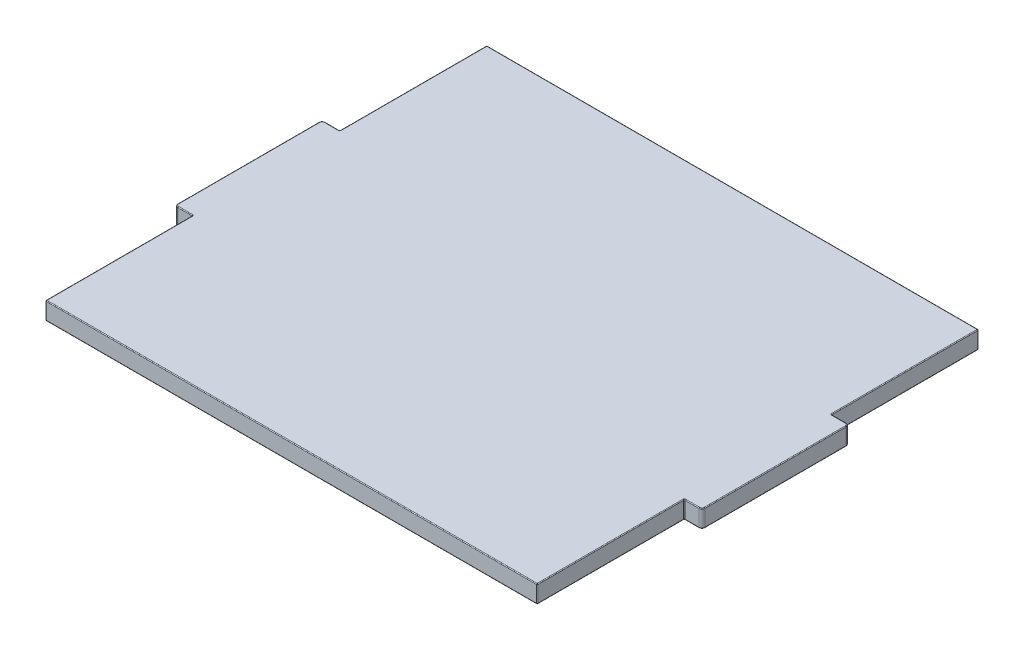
ISO-10303-21;
HEADER;
FILE_DESCRIPTION(('STEP AP214'),'2;1');
FILE_NAME('part.step','',(''),(''),'','','');
FILE_SCHEMA(('AUTOMOTIVE_DESIGN { 1 0 10303 214 1 1 1 1 }'));
ENDSEC;
DATA;
#1=APPLICATION_CONTEXT('core data for automotive mechanical design processes');
#2=APPLICATION_PROTOCOL_DEFINITION('international standard','automotive_design',2000,#1);
#3=PRODUCT_CONTEXT('',#1,'mechanical');
#4=PRODUCT('Part','Part','',(#3));
#5=PRODUCT_RELATED_PRODUCT_CATEGORY('part','',(#4));
#6=PRODUCT_DEFINITION_FORMATION('','',#4);
#7=PRODUCT_DEFINITION_CONTEXT('part definition',#1,'design');
#8=PRODUCT_DEFINITION('design','',#6,#7);
#9=PRODUCT_DEFINITION_SHAPE('','',#8);
#10=(LENGTH_UNIT() NAMED_UNIT(*) SI_UNIT(.MILLI.,.METRE.));
#11=(NAMED_UNIT(*) PLANE_ANGLE_UNIT() SI_UNIT($,.RADIAN.));
#12=(NAMED_UNIT(*) SI_UNIT($,.STERADIAN.) SOLID_ANGLE_UNIT());
#13=UNCERTAINTY_MEASURE_WITH_UNIT(LENGTH_MEASURE(1.E-05),#10,'distance_accuracy_value','');
#14=(GEOMETRIC_REPRESENTATION_CONTEXT(3) GLOBAL_UNCERTAINTY_ASSIGNED_CONTEXT((#13)) GLOBAL_UNIT_ASSIGNED_CONTEXT((#10,
#11,#12)) REPRESENTATION_CONTEXT('',''));
#15=CARTESIAN_POINT('',(0.,0.,0.));
#16=DIRECTION('',(0.,0.,1.));
#17=DIRECTION('',(1.,0.,0.));
#18=AXIS2_PLACEMENT_3D('',#15,#16,#17);
#19=CARTESIAN_POINT('',(0.,12.,0.));
#20=DIRECTION('',(0.,1.,0.));
#21=DIRECTION('',(0.,0.,1.));
#22=AXIS2_PLACEMENT_3D('',#19,#20,#21);
#23=PLANE('',#22);
#24=CARTESIAN_POINT('',(-177.125,12.,-48.));
#25=DIRECTION('',(0.,1.,0.));
#26=DIRECTION('',(0.,0.,1.));
#27=AXIS2_PLACEMENT_3D('',#24,#25,#26);
#28=CIRCLE('',#27,1.5);
#29=CARTESIAN_POINT('',(-178.625,12.,-48.));
#30=VERTEX_POINT('',#29);
#31=CARTESIAN_POINT('',(-177.125,12.,-49.5));
#32=VERTEX_POINT('',#31);
#33=EDGE_CURVE('E813',#30,#32,#28,.F.);
#34=ORIENTED_EDGE('',*,*,#33,.F.);
#35=DIRECTION('',(0.,0.,1.));
#36=VECTOR('',#35,1.);
#37=CARTESIAN_POINT('',(-178.625,12.,50.));
#38=LINE('',#37,#36);
#39=CARTESIAN_POINT('',(-178.625,12.,48.));
#40=VERTEX_POINT('',#39);
#41=EDGE_CURVE('E600',#30,#40,#38,.T.);
#42=ORIENTED_EDGE('',*,*,#41,.T.);
#43=CARTESIAN_POINT('',(-177.125,12.,48.));
#44=DIRECTION('',(0.,1.,0.));
#45=DIRECTION('',(0.,0.,1.));
#46=AXIS2_PLACEMENT_3D('',#43,#44,#45);
#47=CIRCLE('',#46,1.5);
#48=CARTESIAN_POINT('',(-177.125,12.,49.5));
#49=VERTEX_POINT('',#48);
#50=EDGE_CURVE('E809',#49,#40,#47,.F.);
#51=ORIENTED_EDGE('',*,*,#50,.F.);
#52=DIRECTION('',(1.,0.,0.));
#53=VECTOR('',#52,1.);
#54=CARTESIAN_POINT('',(-167.125,12.,49.5));
#55=LINE('',#54,#53);
#56=CARTESIAN_POINT('',(-167.625,12.,49.5));
#57=VERTEX_POINT('',#56);
#58=EDGE_CURVE('E608',#49,#57,#55,.T.);
#59=ORIENTED_EDGE('',*,*,#58,.T.);
#60=CARTESIAN_POINT('',(-167.625,12.,50.5));
#61=DIRECTION('',(0.,1.,0.));
#62=DIRECTION('',(0.,0.,1.));
#63=AXIS2_PLACEMENT_3D('',#60,#61,#62);
#64=CIRCLE('',#63,1.);
#65=CARTESIAN_POINT('',(-166.625,12.,50.5));
#66=VERTEX_POINT('',#65);
#67=EDGE_CURVE('E604',#66,#57,#64,.T.);
#68=ORIENTED_EDGE('',*,*,#67,.F.);
#69=DIRECTION('',(0.,0.,1.));
#70=VECTOR('',#69,1.);
#71=CARTESIAN_POINT('',(-166.625,12.,150.));
#72=LINE('',#71,#70);
#73=CARTESIAN_POINT('',(-166.625,12.,149.5));
#74=VERTEX_POINT('',#73);
#75=EDGE_CURVE('E589',#66,#74,#72,.T.);
#76=ORIENTED_EDGE('',*,*,#75,.T.);
#77=DIRECTION('',(1.,0.,0.));
#78=VECTOR('',#77,1.);
#79=CARTESIAN_POINT('',(167.125,12.,149.5));
#80=LINE('',#79,#78);
#81=CARTESIAN_POINT('',(166.625,12.,149.5));
#82=VERTEX_POINT('',#81);
#83=EDGE_CURVE('E572',#74,#82,#80,.T.);
#84=ORIENTED_EDGE('',*,*,#83,.T.);
#85=DIRECTION('',(0.,0.,-1.));
#86=VECTOR('',#85,1.);
#87=CARTESIAN_POINT('',(166.625,12.,50.));
#88=LINE('',#87,#86);
#89=CARTESIAN_POINT('',(166.625,12.,50.5));
#90=VERTEX_POINT('',#89);
#91=EDGE_CURVE('E558',#82,#90,#88,.T.);
#92=ORIENTED_EDGE('',*,*,#91,.T.);
#93=CARTESIAN_POINT('',(167.625,12.,50.5));
#94=DIRECTION('',(0.,1.,0.));
#95=DIRECTION('',(0.,0.,1.));
#96=AXIS2_PLACEMENT_3D('',#93,#94,#95);
#97=CIRCLE('',#96,1.);
#98=CARTESIAN_POINT('',(167.625,12.,49.5));
#99=VERTEX_POINT('',#98);
#100=EDGE_CURVE('E554',#99,#90,#97,.T.);
#101=ORIENTED_EDGE('',*,*,#100,.F.);
#102=DIRECTION('',(1.,0.,0.));
#103=VECTOR('',#102,1.);
#104=CARTESIAN_POINT('',(179.125,12.,49.5));
#105=LINE('',#104,#103);
#106=CARTESIAN_POINT('',(177.125,12.,49.5));
#107=VERTEX_POINT('',#106);
#108=EDGE_CURVE('E561',#99,#107,#105,.T.);
#109=ORIENTED_EDGE('',*,*,#108,.T.);
#110=CARTESIAN_POINT('',(177.125,12.,48.));
#111=DIRECTION('',(0.,1.,0.));
#112=DIRECTION('',(0.,0.,1.));
#113=AXIS2_PLACEMENT_3D('',#110,#111,#112);
#114=CIRCLE('',#113,1.5);
#115=CARTESIAN_POINT('',(178.625,12.,48.));
#116=VERTEX_POINT('',#115);
#117=EDGE_CURVE('E805',#116,#107,#114,.F.);
#118=ORIENTED_EDGE('',*,*,#117,.F.);
#119=DIRECTION('',(0.,0.,-1.));
#120=VECTOR('',#119,1.);
#121=CARTESIAN_POINT('',(178.625,12.,-50.));
#122=LINE('',#121,#120);
#123=CARTESIAN_POINT('',(178.625,12.,-48.));
#124=VERTEX_POINT('',#123);
#125=EDGE_CURVE('E565',#116,#124,#122,.T.);
#126=ORIENTED_EDGE('',*,*,#125,.T.);
#127=CARTESIAN_POINT('',(177.125,12.,-48.));
#128=DIRECTION('',(0.,1.,0.));
#129=DIRECTION('',(0.,0.,1.));
#130=AXIS2_PLACEMENT_3D('',#127,#128,#129);
#131=CIRCLE('',#130,1.5);
#132=CARTESIAN_POINT('',(177.125,12.,-49.5));
#133=VERTEX_POINT('',#132);
#134=EDGE_CURVE('E801',#133,#124,#131,.F.);
#135=ORIENTED_EDGE('',*,*,#134,.F.);
#136=DIRECTION('',(-1.,0.,0.));
#137=VECTOR('',#136,1.);
#138=CARTESIAN_POINT('',(167.125,12.,-49.5));
#139=LINE('',#138,#137);
#140=CARTESIAN_POINT('',(167.625,12.,-49.5));
#141=VERTEX_POINT('',#140);
#142=EDGE_CURVE('E569',#133,#141,#139,.T.);
#143=ORIENTED_EDGE('',*,*,#142,.T.);
#144=CARTESIAN_POINT('',(167.625,12.,-50.5));
#145=DIRECTION('',(0.,1.,0.));
#146=DIRECTION('',(0.,0.,1.));
#147=AXIS2_PLACEMENT_3D('',#144,#145,#146);
#148=CIRCLE('',#147,1.);
#149=CARTESIAN_POINT('',(166.625,12.,-50.5));
#150=VERTEX_POINT('',#149);
#151=EDGE_CURVE('E576',#150,#141,#148,.T.);
#152=ORIENTED_EDGE('',*,*,#151,.F.);
#153=DIRECTION('',(0.,0.,-1.));
#154=VECTOR('',#153,1.);
#155=CARTESIAN_POINT('',(166.625,12.,-150.));
#156=LINE('',#155,#154);
#157=CARTESIAN_POINT('',(166.625,12.,-149.5));
#158=VERTEX_POINT('',#157);
#159=EDGE_CURVE('E580',#150,#158,#156,.T.);
#160=ORIENTED_EDGE('',*,*,#159,.T.);
#161=DIRECTION('',(-1.,0.,0.));
#162=VECTOR('',#161,1.);
#163=CARTESIAN_POINT('',(-167.125,12.,-149.5));
#164=LINE('',#163,#162);
#165=CARTESIAN_POINT('',(-166.625,12.,-149.5));
#166=VERTEX_POINT('',#165);
#167=EDGE_CURVE('E583',#158,#166,#164,.T.);
#168=ORIENTED_EDGE('',*,*,#167,.T.);
#169=DIRECTION('',(0.,0.,1.));
#170=VECTOR('',#169,1.);
#171=CARTESIAN_POINT('',(-166.625,12.,-50.));
#172=LINE('',#171,#170);
#173=CARTESIAN_POINT('',(-166.625,12.,-50.5));
#174=VERTEX_POINT('',#173);
#175=EDGE_CURVE('E586',#166,#174,#172,.T.);
#176=ORIENTED_EDGE('',*,*,#175,.T.);
#177=CARTESIAN_POINT('',(-167.625,12.,-50.5));
#178=DIRECTION('',(0.,1.,0.));
#179=DIRECTION('',(0.,0.,1.));
#180=AXIS2_PLACEMENT_3D('',#177,#178,#179);
#181=CIRCLE('',#180,1.);
#182=CARTESIAN_POINT('',(-167.625,12.,-49.5));
#183=VERTEX_POINT('',#182);
#184=EDGE_CURVE('E592',#183,#174,#181,.T.);
#185=ORIENTED_EDGE('',*,*,#184,.F.);
#186=DIRECTION('',(-1.,0.,0.));
#187=VECTOR('',#186,1.);
#188=CARTESIAN_POINT('',(-179.125,12.,-49.5));
#189=LINE('',#188,#187);
#190=EDGE_CURVE('E596',#183,#32,#189,.T.);
#191=ORIENTED_EDGE('',*,*,#190,.T.);
#192=EDGE_LOOP('',(#34,#42,#51,#59,#68,#76,#84,#92,#101,#109,#118,#126,#135,#143,#152,#160,#168,
#176,#185,#191));
#193=FACE_BOUND('',#192,.T.);
#194=ADVANCED_FACE('F40',(#193),#23,.T.);
#195=CARTESIAN_POINT('',(0.,0.,0.));
#196=DIRECTION('',(0.,1.,0.));
#197=DIRECTION('',(0.,0.,1.));
#198=AXIS2_PLACEMENT_3D('',#195,#196,#197);
#199=PLANE('',#198);
#200=CARTESIAN_POINT('',(-177.125,0.,-48.));
#201=DIRECTION('',(0.,1.,0.));
#202=DIRECTION('',(0.,0.,1.));
#203=AXIS2_PLACEMENT_3D('',#200,#201,#202);
#204=CIRCLE('',#203,1.5);
#205=CARTESIAN_POINT('',(-177.125,0.,-49.5));
#206=VERTEX_POINT('',#205);
#207=CARTESIAN_POINT('',(-178.625,0.,-48.));
#208=VERTEX_POINT('',#207);
#209=EDGE_CURVE('E788',#206,#208,#204,.T.);
#210=ORIENTED_EDGE('',*,*,#209,.F.);
#211=DIRECTION('',(-1.,0.,0.));
#212=VECTOR('',#211,1.);
#213=CARTESIAN_POINT('',(0.,0.,-49.5));
#214=LINE('',#213,#212);
#215=CARTESIAN_POINT('',(-167.625,0.,-49.5));
#216=VERTEX_POINT('',#215);
#217=EDGE_CURVE('E510',#206,#216,#214,.F.);
#218=ORIENTED_EDGE('',*,*,#217,.T.);
#219=CARTESIAN_POINT('',(-167.625,0.,-50.5));
#220=DIRECTION('',(0.,1.,0.));
#221=DIRECTION('',(0.,0.,1.));
#222=AXIS2_PLACEMENT_3D('',#219,#220,#221);
#223=CIRCLE('',#222,1.);
#224=CARTESIAN_POINT('',(-166.625,0.,-50.5));
#225=VERTEX_POINT('',#224);
#226=EDGE_CURVE('E517',#225,#216,#223,.F.);
#227=ORIENTED_EDGE('',*,*,#226,.F.);
#228=DIRECTION('',(0.,0.,1.));
#229=VECTOR('',#228,1.);
#230=CARTESIAN_POINT('',(-166.625,0.,0.));
#231=LINE('',#230,#229);
#232=CARTESIAN_POINT('',(-166.625,0.,-149.5));
#233=VERTEX_POINT('',#232);
#234=EDGE_CURVE('E521',#225,#233,#231,.F.);
#235=ORIENTED_EDGE('',*,*,#234,.T.);
#236=DIRECTION('',(-1.,0.,0.));
#237=VECTOR('',#236,1.);
#238=CARTESIAN_POINT('',(0.,0.,-149.5));
#239=LINE('',#238,#237);
#240=CARTESIAN_POINT('',(166.625,0.,-149.5));
#241=VERTEX_POINT('',#240);
#242=EDGE_CURVE('E524',#233,#241,#239,.F.);
#243=ORIENTED_EDGE('',*,*,#242,.T.);
#244=DIRECTION('',(0.,0.,-1.));
#245=VECTOR('',#244,1.);
#246=CARTESIAN_POINT('',(166.625,0.,0.));
#247=LINE('',#246,#245);
#248=CARTESIAN_POINT('',(166.625,0.,-50.5));
#249=VERTEX_POINT('',#248);
#250=EDGE_CURVE('E527',#241,#249,#247,.F.);
#251=ORIENTED_EDGE('',*,*,#250,.T.);
#252=CARTESIAN_POINT('',(167.625,0.,-50.5));
#253=DIRECTION('',(0.,1.,0.));
#254=DIRECTION('',(0.,0.,1.));
#255=AXIS2_PLACEMENT_3D('',#252,#253,#254);
#256=CIRCLE('',#255,1.);
#257=CARTESIAN_POINT('',(167.625,0.,-49.5));
#258=VERTEX_POINT('',#257);
#259=EDGE_CURVE('E534',#258,#249,#256,.F.);
#260=ORIENTED_EDGE('',*,*,#259,.F.);
#261=DIRECTION('',(-1.,0.,0.));
#262=VECTOR('',#261,1.);
#263=CARTESIAN_POINT('',(0.,0.,-49.5));
#264=LINE('',#263,#262);
#265=CARTESIAN_POINT('',(177.125,0.,-49.5));
#266=VERTEX_POINT('',#265);
#267=EDGE_CURVE('E530',#258,#266,#264,.F.);
#268=ORIENTED_EDGE('',*,*,#267,.T.);
#269=CARTESIAN_POINT('',(177.125,0.,-48.));
#270=DIRECTION('',(0.,1.,0.));
#271=DIRECTION('',(0.,0.,1.));
#272=AXIS2_PLACEMENT_3D('',#269,#270,#271);
#273=CIRCLE('',#272,1.5);
#274=CARTESIAN_POINT('',(178.625,0.,-48.));
#275=VERTEX_POINT('',#274);
#276=EDGE_CURVE('E611',#275,#266,#273,.T.);
#277=ORIENTED_EDGE('',*,*,#276,.F.);
#278=DIRECTION('',(0.,0.,-1.));
#279=VECTOR('',#278,1.);
#280=CARTESIAN_POINT('',(178.625,0.,0.));
#281=LINE('',#280,#279);
#282=CARTESIAN_POINT('',(178.625,0.,48.));
#283=VERTEX_POINT('',#282);
#284=EDGE_CURVE('E513',#275,#283,#281,.F.);
#285=ORIENTED_EDGE('',*,*,#284,.T.);
#286=CARTESIAN_POINT('',(177.125,0.,48.));
#287=DIRECTION('',(0.,1.,0.));
#288=DIRECTION('',(0.,0.,1.));
#289=AXIS2_PLACEMENT_3D('',#286,#287,#288);
#290=CIRCLE('',#289,1.5);
#291=CARTESIAN_POINT('',(177.125,0.,49.5));
#292=VERTEX_POINT('',#291);
#293=EDGE_CURVE('E781',#292,#283,#290,.T.);
#294=ORIENTED_EDGE('',*,*,#293,.F.);
#295=DIRECTION('',(1.,0.,0.));
#296=VECTOR('',#295,1.);
#297=CARTESIAN_POINT('',(0.,0.,49.5));
#298=LINE('',#297,#296);
#299=CARTESIAN_POINT('',(167.625,0.,49.5));
#300=VERTEX_POINT('',#299);
#301=EDGE_CURVE('E495',#292,#300,#298,.F.);
#302=ORIENTED_EDGE('',*,*,#301,.T.);
#303=CARTESIAN_POINT('',(167.625,0.,50.5));
#304=DIRECTION('',(0.,1.,0.));
#305=DIRECTION('',(0.,0.,1.));
#306=AXIS2_PLACEMENT_3D('',#303,#304,#305);
#307=CIRCLE('',#306,1.);
#308=CARTESIAN_POINT('',(166.625,0.,50.5));
#309=VERTEX_POINT('',#308);
#310=EDGE_CURVE('E491',#309,#300,#307,.F.);
#311=ORIENTED_EDGE('',*,*,#310,.F.);
#312=DIRECTION('',(0.,0.,-1.));
#313=VECTOR('',#312,1.);
#314=CARTESIAN_POINT('',(166.625,0.,0.));
#315=LINE('',#314,#313);
#316=CARTESIAN_POINT('',(166.625,0.,149.5));
#317=VERTEX_POINT('',#316);
#318=EDGE_CURVE('E482',#309,#317,#315,.F.);
#319=ORIENTED_EDGE('',*,*,#318,.T.);
#320=DIRECTION('',(1.,0.,0.));
#321=VECTOR('',#320,1.);
#322=CARTESIAN_POINT('',(0.,0.,149.5));
#323=LINE('',#322,#321);
#324=CARTESIAN_POINT('',(-166.625,0.,149.5));
#325=VERTEX_POINT('',#324);
#326=EDGE_CURVE('E485',#317,#325,#323,.F.);
#327=ORIENTED_EDGE('',*,*,#326,.T.);
#328=DIRECTION('',(0.,0.,1.));
#329=VECTOR('',#328,1.);
#330=CARTESIAN_POINT('',(-166.625,0.,0.));
#331=LINE('',#330,#329);
#332=CARTESIAN_POINT('',(-166.625,0.,50.5));
#333=VERTEX_POINT('',#332);
#334=EDGE_CURVE('E488',#325,#333,#331,.F.);
#335=ORIENTED_EDGE('',*,*,#334,.T.);
#336=CARTESIAN_POINT('',(-167.625,0.,50.5));
#337=DIRECTION('',(0.,1.,0.));
#338=DIRECTION('',(0.,0.,1.));
#339=AXIS2_PLACEMENT_3D('',#336,#337,#338);
#340=CIRCLE('',#339,1.);
#341=CARTESIAN_POINT('',(-167.625,0.,49.5));
#342=VERTEX_POINT('',#341);
#343=EDGE_CURVE('E498',#342,#333,#340,.F.);
#344=ORIENTED_EDGE('',*,*,#343,.F.);
#345=DIRECTION('',(1.,0.,0.));
#346=VECTOR('',#345,1.);
#347=CARTESIAN_POINT('',(0.,0.,49.5));
#348=LINE('',#347,#346);
#349=CARTESIAN_POINT('',(-177.125,0.,49.5));
#350=VERTEX_POINT('',#349);
#351=EDGE_CURVE('E502',#342,#350,#348,.F.);
#352=ORIENTED_EDGE('',*,*,#351,.T.);
#353=CARTESIAN_POINT('',(-177.125,0.,48.));
#354=DIRECTION('',(0.,1.,0.));
#355=DIRECTION('',(0.,0.,1.));
#356=AXIS2_PLACEMENT_3D('',#353,#354,#355);
#357=CIRCLE('',#356,1.5);
#358=CARTESIAN_POINT('',(-178.625,0.,48.));
#359=VERTEX_POINT('',#358);
#360=EDGE_CURVE('E784',#359,#350,#357,.T.);
#361=ORIENTED_EDGE('',*,*,#360,.F.);
#362=DIRECTION('',(0.,0.,1.));
#363=VECTOR('',#362,1.);
#364=CARTESIAN_POINT('',(-178.625,0.,0.));
#365=LINE('',#364,#363);
#366=EDGE_CURVE('E506',#359,#208,#365,.F.);
#367=ORIENTED_EDGE('',*,*,#366,.T.);
#368=EDGE_LOOP('',(#210,#218,#227,#235,#243,#251,#260,#268,#277,#285,#294,#302,#311,#319,#327,
#335,#344,#352,#361,#367));
#369=FACE_BOUND('',#368,.T.);
#370=ADVANCED_FACE('F945',(#369),#199,.F.);
#371=CARTESIAN_POINT('',(167.125,12.,50.));
#372=DIRECTION('',(-1.,0.,0.));
#373=DIRECTION('',(0.,0.,1.));
#374=AXIS2_PLACEMENT_3D('',#371,#372,#373);
#375=PLANE('',#374);
#376=DIRECTION('',(0.,-1.,0.));
#377=VECTOR('',#376,1.);
#378=CARTESIAN_POINT('',(167.125,12.,149.5));
#379=LINE('',#378,#377);
#380=CARTESIAN_POINT('',(167.125,11.5,149.5));
#381=VERTEX_POINT('',#380);
#382=CARTESIAN_POINT('',(167.125,0.5,149.5));
#383=VERTEX_POINT('',#382);
#384=EDGE_CURVE('E461',#381,#383,#379,.T.);
#385=ORIENTED_EDGE('',*,*,#384,.T.);
#386=DIRECTION('',(0.,0.,-1.));
#387=VECTOR('',#386,1.);
#388=CARTESIAN_POINT('',(167.125,0.5,50.));
#389=LINE('',#388,#387);
#390=CARTESIAN_POINT('',(167.125,0.5,50.5));
#391=VERTEX_POINT('',#390);
#392=EDGE_CURVE('E468',#383,#391,#389,.T.);
#393=ORIENTED_EDGE('',*,*,#392,.T.);
#394=DIRECTION('',(0.,-1.,0.));
#395=VECTOR('',#394,1.);
#396=CARTESIAN_POINT('',(167.125,12.,50.5));
#397=LINE('',#396,#395);
#398=CARTESIAN_POINT('',(167.125,11.5,50.5));
#399=VERTEX_POINT('',#398);
#400=EDGE_CURVE('E464',#391,#399,#397,.F.);
#401=ORIENTED_EDGE('',*,*,#400,.T.);
#402=DIRECTION('',(0.,0.,-1.));
#403=VECTOR('',#402,1.);
#404=CARTESIAN_POINT('',(167.125,11.5,150.));
#405=LINE('',#404,#403);
#406=EDGE_CURVE('E458',#399,#381,#405,.F.);
#407=ORIENTED_EDGE('',*,*,#406,.T.);
#408=EDGE_LOOP('',(#385,#393,#401,#407));
#409=FACE_BOUND('',#408,.T.);
#410=ADVANCED_FACE('F1070',(#409),#375,.F.);
#411=CARTESIAN_POINT('',(179.125,12.,50.));
#412=DIRECTION('',(0.,0.,-1.));
#413=DIRECTION('',(-1.,0.,0.));
#414=AXIS2_PLACEMENT_3D('',#411,#412,#413);
#415=PLANE('',#414);
#416=DIRECTION('',(1.,0.,0.));
#417=VECTOR('',#416,1.);
#418=CARTESIAN_POINT('',(179.125,0.5,50.));
#419=LINE('',#418,#417);
#420=CARTESIAN_POINT('',(167.625,0.5,50.));
#421=VERTEX_POINT('',#420);
#422=CARTESIAN_POINT('',(177.125,0.5,50.));
#423=VERTEX_POINT('',#422);
#424=EDGE_CURVE('E454',#421,#423,#419,.T.);
#425=ORIENTED_EDGE('',*,*,#424,.T.);
#426=DIRECTION('',(0.,-1.,0.));
#427=VECTOR('',#426,1.);
#428=CARTESIAN_POINT('',(177.125,12.,50.));
#429=LINE('',#428,#427);
#430=CARTESIAN_POINT('',(177.125,11.5,50.));
#431=VERTEX_POINT('',#430);
#432=EDGE_CURVE('E865',#423,#431,#429,.F.);
#433=ORIENTED_EDGE('',*,*,#432,.T.);
#434=DIRECTION('',(1.,0.,0.));
#435=VECTOR('',#434,1.);
#436=CARTESIAN_POINT('',(167.125,11.5,50.));
#437=LINE('',#436,#435);
#438=CARTESIAN_POINT('',(167.625,11.5,50.));
#439=VERTEX_POINT('',#438);
#440=EDGE_CURVE('E448',#431,#439,#437,.F.);
#441=ORIENTED_EDGE('',*,*,#440,.T.);
#442=DIRECTION('',(0.,-1.,0.));
#443=VECTOR('',#442,1.);
#444=CARTESIAN_POINT('',(167.625,0.,50.));
#445=LINE('',#444,#443);
#446=EDGE_CURVE('E451',#439,#421,#445,.T.);
#447=ORIENTED_EDGE('',*,*,#446,.T.);
#448=EDGE_LOOP('',(#425,#433,#441,#447));
#449=FACE_BOUND('',#448,.T.);
#450=ADVANCED_FACE('F1106',(#449),#415,.F.);
#451=CARTESIAN_POINT('',(179.125,12.,-50.));
#452=DIRECTION('',(-1.,0.,0.));
#453=DIRECTION('',(0.,0.,1.));
#454=AXIS2_PLACEMENT_3D('',#451,#452,#453);
#455=PLANE('',#454);
#456=DIRECTION('',(0.,0.,-1.));
#457=VECTOR('',#456,1.);
#458=CARTESIAN_POINT('',(179.125,0.5,-50.));
#459=LINE('',#458,#457);
#460=CARTESIAN_POINT('',(179.125,0.5,48.));
#461=VERTEX_POINT('',#460);
#462=CARTESIAN_POINT('',(179.125,0.5,-48.));
#463=VERTEX_POINT('',#462);
#464=EDGE_CURVE('E542',#461,#463,#459,.T.);
#465=ORIENTED_EDGE('',*,*,#464,.T.);
#466=DIRECTION('',(0.,-1.,0.));
#467=VECTOR('',#466,1.);
#468=CARTESIAN_POINT('',(179.125,12.,-48.));
#469=LINE('',#468,#467);
#470=CARTESIAN_POINT('',(179.125,11.5,-48.));
#471=VERTEX_POINT('',#470);
#472=EDGE_CURVE('E862',#463,#471,#469,.F.);
#473=ORIENTED_EDGE('',*,*,#472,.T.);
#474=DIRECTION('',(0.,0.,-1.));
#475=VECTOR('',#474,1.);
#476=CARTESIAN_POINT('',(179.125,11.5,50.));
#477=LINE('',#476,#475);
#478=CARTESIAN_POINT('',(179.125,11.5,48.));
#479=VERTEX_POINT('',#478);
#480=EDGE_CURVE('E538',#471,#479,#477,.F.);
#481=ORIENTED_EDGE('',*,*,#480,.T.);
#482=DIRECTION('',(0.,-1.,0.));
#483=VECTOR('',#482,1.);
#484=CARTESIAN_POINT('',(179.125,12.,48.));
#485=LINE('',#484,#483);
#486=EDGE_CURVE('E859',#479,#461,#485,.T.);
#487=ORIENTED_EDGE('',*,*,#486,.T.);
#488=EDGE_LOOP('',(#465,#473,#481,#487));
#489=FACE_BOUND('',#488,.T.);
#490=ADVANCED_FACE('F929',(#489),#455,.F.);
#491=CARTESIAN_POINT('',(179.125,12.,-50.));
#492=DIRECTION('',(0.,0.,1.));
#493=DIRECTION('',(1.,0.,0.));
#494=AXIS2_PLACEMENT_3D('',#491,#492,#493);
#495=PLANE('',#494);
#496=DIRECTION('',(-1.,0.,0.));
#497=VECTOR('',#496,1.);
#498=CARTESIAN_POINT('',(179.125,11.5,-50.));
#499=LINE('',#498,#497);
#500=CARTESIAN_POINT('',(167.625,11.5,-50.));
#501=VERTEX_POINT('',#500);
#502=CARTESIAN_POINT('',(177.125,11.5,-50.));
#503=VERTEX_POINT('',#502);
#504=EDGE_CURVE('E437',#501,#503,#499,.F.);
#505=ORIENTED_EDGE('',*,*,#504,.T.);
#506=DIRECTION('',(0.,-1.,0.));
#507=VECTOR('',#506,1.);
#508=CARTESIAN_POINT('',(177.125,12.,-50.));
#509=LINE('',#508,#507);
#510=CARTESIAN_POINT('',(177.125,0.5,-50.));
#511=VERTEX_POINT('',#510);
#512=EDGE_CURVE('E856',#503,#511,#509,.T.);
#513=ORIENTED_EDGE('',*,*,#512,.T.);
#514=DIRECTION('',(-1.,0.,0.));
#515=VECTOR('',#514,1.);
#516=CARTESIAN_POINT('',(179.125,0.5,-50.));
#517=LINE('',#516,#515);
#518=CARTESIAN_POINT('',(167.625,0.5,-50.));
#519=VERTEX_POINT('',#518);
#520=EDGE_CURVE('E445',#511,#519,#517,.T.);
#521=ORIENTED_EDGE('',*,*,#520,.T.);
#522=DIRECTION('',(0.,-1.,0.));
#523=VECTOR('',#522,1.);
#524=CARTESIAN_POINT('',(167.625,12.,-50.));
#525=LINE('',#524,#523);
#526=EDGE_CURVE('E441',#519,#501,#525,.F.);
#527=ORIENTED_EDGE('',*,*,#526,.T.);
#528=EDGE_LOOP('',(#505,#513,#521,#527));
#529=FACE_BOUND('',#528,.T.);
#530=ADVANCED_FACE('F1099',(#529),#495,.F.);
#531=CARTESIAN_POINT('',(167.125,12.,-150.));
#532=DIRECTION('',(-1.,0.,0.));
#533=DIRECTION('',(0.,0.,1.));
#534=AXIS2_PLACEMENT_3D('',#531,#532,#533);
#535=PLANE('',#534);
#536=DIRECTION('',(0.,-1.,0.));
#537=VECTOR('',#536,1.);
#538=CARTESIAN_POINT('',(167.125,0.,-50.5));
#539=LINE('',#538,#537);
#540=CARTESIAN_POINT('',(167.125,11.5,-50.5));
#541=VERTEX_POINT('',#540);
#542=CARTESIAN_POINT('',(167.125,0.5,-50.5));
#543=VERTEX_POINT('',#542);
#544=EDGE_CURVE('E430',#541,#543,#539,.T.);
#545=ORIENTED_EDGE('',*,*,#544,.T.);
#546=DIRECTION('',(0.,0.,-1.));
#547=VECTOR('',#546,1.);
#548=CARTESIAN_POINT('',(167.125,0.5,-150.));
#549=LINE('',#548,#547);
#550=CARTESIAN_POINT('',(167.125,0.5,-149.5));
#551=VERTEX_POINT('',#550);
#552=EDGE_CURVE('E434',#543,#551,#549,.T.);
#553=ORIENTED_EDGE('',*,*,#552,.T.);
#554=DIRECTION('',(0.,-1.,0.));
#555=VECTOR('',#554,1.);
#556=CARTESIAN_POINT('',(167.125,12.,-149.5));
#557=LINE('',#556,#555);
#558=CARTESIAN_POINT('',(167.125,11.5,-149.5));
#559=VERTEX_POINT('',#558);
#560=EDGE_CURVE('E427',#551,#559,#557,.F.);
#561=ORIENTED_EDGE('',*,*,#560,.T.);
#562=DIRECTION('',(0.,0.,-1.));
#563=VECTOR('',#562,1.);
#564=CARTESIAN_POINT('',(167.125,11.5,-50.));
#565=LINE('',#564,#563);
#566=EDGE_CURVE('E424',#559,#541,#565,.F.);
#567=ORIENTED_EDGE('',*,*,#566,.T.);
#568=EDGE_LOOP('',(#545,#553,#561,#567));
#569=FACE_BOUND('',#568,.T.);
#570=ADVANCED_FACE('F1095',(#569),#535,.F.);
#571=CARTESIAN_POINT('',(-167.125,12.,-150.));
#572=DIRECTION('',(0.,0.,1.));
#573=DIRECTION('',(1.,0.,0.));
#574=AXIS2_PLACEMENT_3D('',#571,#572,#573);
#575=PLANE('',#574);
#576=DIRECTION('',(0.,-1.,0.));
#577=VECTOR('',#576,1.);
#578=CARTESIAN_POINT('',(166.625,12.,-150.));
#579=LINE('',#578,#577);
#580=CARTESIAN_POINT('',(166.625,11.5,-150.));
#581=VERTEX_POINT('',#580);
#582=CARTESIAN_POINT('',(166.625,0.5,-150.));
#583=VERTEX_POINT('',#582);
#584=EDGE_CURVE('E405',#581,#583,#579,.T.);
#585=ORIENTED_EDGE('',*,*,#584,.T.);
#586=DIRECTION('',(-1.,0.,0.));
#587=VECTOR('',#586,1.);
#588=CARTESIAN_POINT('',(-167.125,0.5,-150.));
#589=LINE('',#588,#587);
#590=CARTESIAN_POINT('',(-166.625,0.5,-150.));
#591=VERTEX_POINT('',#590);
#592=EDGE_CURVE('E412',#583,#591,#589,.T.);
#593=ORIENTED_EDGE('',*,*,#592,.T.);
#594=DIRECTION('',(0.,-1.,0.));
#595=VECTOR('',#594,1.);
#596=CARTESIAN_POINT('',(-166.625,12.,-150.));
#597=LINE('',#596,#595);
#598=CARTESIAN_POINT('',(-166.625,11.5,-150.));
#599=VERTEX_POINT('',#598);
#600=EDGE_CURVE('E408',#591,#599,#597,.F.);
#601=ORIENTED_EDGE('',*,*,#600,.T.);
#602=DIRECTION('',(-1.,0.,0.));
#603=VECTOR('',#602,1.);
#604=CARTESIAN_POINT('',(167.125,11.5,-150.));
#605=LINE('',#604,#603);
#606=EDGE_CURVE('E402',#599,#581,#605,.F.);
#607=ORIENTED_EDGE('',*,*,#606,.T.);
#608=EDGE_LOOP('',(#585,#593,#601,#607));
#609=FACE_BOUND('',#608,.T.);
#610=ADVANCED_FACE('F1092',(#609),#575,.F.);
#611=CARTESIAN_POINT('',(-167.125,12.,-150.));
#612=DIRECTION('',(1.,0.,0.));
#613=DIRECTION('',(0.,0.,-1.));
#614=AXIS2_PLACEMENT_3D('',#611,#612,#613);
#615=PLANE('',#614);
#616=DIRECTION('',(0.,-1.,0.));
#617=VECTOR('',#616,1.);
#618=CARTESIAN_POINT('',(-167.125,12.,-149.5));
#619=LINE('',#618,#617);
#620=CARTESIAN_POINT('',(-167.125,11.5,-149.5));
#621=VERTEX_POINT('',#620);
#622=CARTESIAN_POINT('',(-167.125,0.5,-149.5));
#623=VERTEX_POINT('',#622);
#624=EDGE_CURVE('E395',#621,#623,#619,.T.);
#625=ORIENTED_EDGE('',*,*,#624,.T.);
#626=DIRECTION('',(0.,0.,1.));
#627=VECTOR('',#626,1.);
#628=CARTESIAN_POINT('',(-167.125,0.5,-150.));
#629=LINE('',#628,#627);
#630=CARTESIAN_POINT('',(-167.125,0.5,-50.5));
#631=VERTEX_POINT('',#630);
#632=EDGE_CURVE('E399',#623,#631,#629,.T.);
#633=ORIENTED_EDGE('',*,*,#632,.T.);
#634=DIRECTION('',(0.,-1.,0.));
#635=VECTOR('',#634,1.);
#636=CARTESIAN_POINT('',(-167.125,12.,-50.5));
#637=LINE('',#636,#635);
#638=CARTESIAN_POINT('',(-167.125,11.5,-50.5));
#639=VERTEX_POINT('',#638);
#640=EDGE_CURVE('E392',#631,#639,#637,.F.);
#641=ORIENTED_EDGE('',*,*,#640,.T.);
#642=DIRECTION('',(0.,0.,1.));
#643=VECTOR('',#642,1.);
#644=CARTESIAN_POINT('',(-167.125,11.5,-150.));
#645=LINE('',#644,#643);
#646=EDGE_CURVE('E389',#639,#621,#645,.F.);
#647=ORIENTED_EDGE('',*,*,#646,.T.);
#648=EDGE_LOOP('',(#625,#633,#641,#647));
#649=FACE_BOUND('',#648,.T.);
#650=ADVANCED_FACE('F1028',(#649),#615,.F.);
#651=CARTESIAN_POINT('',(-179.125,12.,-50.));
#652=DIRECTION('',(0.,0.,1.));
#653=DIRECTION('',(1.,0.,0.));
#654=AXIS2_PLACEMENT_3D('',#651,#652,#653);
#655=PLANE('',#654);
#656=DIRECTION('',(-1.,0.,0.));
#657=VECTOR('',#656,1.);
#658=CARTESIAN_POINT('',(-179.125,0.5,-50.));
#659=LINE('',#658,#657);
#660=CARTESIAN_POINT('',(-167.625,0.5,-50.));
#661=VERTEX_POINT('',#660);
#662=CARTESIAN_POINT('',(-177.125,0.5,-50.));
#663=VERTEX_POINT('',#662);
#664=EDGE_CURVE('E421',#661,#663,#659,.T.);
#665=ORIENTED_EDGE('',*,*,#664,.T.);
#666=DIRECTION('',(0.,-1.,0.));
#667=VECTOR('',#666,1.);
#668=CARTESIAN_POINT('',(-177.125,12.,-50.));
#669=LINE('',#668,#667);
#670=CARTESIAN_POINT('',(-177.125,11.5,-50.));
#671=VERTEX_POINT('',#670);
#672=EDGE_CURVE('E11',#663,#671,#669,.F.);
#673=ORIENTED_EDGE('',*,*,#672,.T.);
#674=DIRECTION('',(-1.,0.,0.));
#675=VECTOR('',#674,1.);
#676=CARTESIAN_POINT('',(-167.125,11.5,-50.));
#677=LINE('',#676,#675);
#678=CARTESIAN_POINT('',(-167.625,11.5,-50.));
#679=VERTEX_POINT('',#678);
#680=EDGE_CURVE('E415',#671,#679,#677,.F.);
#681=ORIENTED_EDGE('',*,*,#680,.T.);
#682=DIRECTION('',(0.,-1.,0.));
#683=VECTOR('',#682,1.);
#684=CARTESIAN_POINT('',(-167.625,0.,-50.));
#685=LINE('',#684,#683);
#686=EDGE_CURVE('E418',#679,#661,#685,.T.);
#687=ORIENTED_EDGE('',*,*,#686,.T.);
#688=EDGE_LOOP('',(#665,#673,#681,#687));
#689=FACE_BOUND('',#688,.T.);
#690=ADVANCED_FACE('F1085',(#689),#655,.F.);
#691=CARTESIAN_POINT('',(-179.125,12.,-50.));
#692=DIRECTION('',(1.,0.,0.));
#693=DIRECTION('',(0.,0.,-1.));
#694=AXIS2_PLACEMENT_3D('',#691,#692,#693);
#695=PLANE('',#694);
#696=DIRECTION('',(0.,0.,1.));
#697=VECTOR('',#696,1.);
#698=CARTESIAN_POINT('',(-179.125,0.5,-50.));
#699=LINE('',#698,#697);
#700=CARTESIAN_POINT('',(-179.125,0.5,-48.));
#701=VERTEX_POINT('',#700);
#702=CARTESIAN_POINT('',(-179.125,0.5,48.));
#703=VERTEX_POINT('',#702);
#704=EDGE_CURVE('E550',#701,#703,#699,.T.);
#705=ORIENTED_EDGE('',*,*,#704,.T.);
#706=DIRECTION('',(0.,-1.,0.));
#707=VECTOR('',#706,1.);
#708=CARTESIAN_POINT('',(-179.125,12.,48.));
#709=LINE('',#708,#707);
#710=CARTESIAN_POINT('',(-179.125,11.5,48.));
#711=VERTEX_POINT('',#710);
#712=EDGE_CURVE('E50',#703,#711,#709,.F.);
#713=ORIENTED_EDGE('',*,*,#712,.T.);
#714=DIRECTION('',(0.,0.,1.));
#715=VECTOR('',#714,1.);
#716=CARTESIAN_POINT('',(-179.125,11.5,-50.));
#717=LINE('',#716,#715);
#718=CARTESIAN_POINT('',(-179.125,11.5,-48.));
#719=VERTEX_POINT('',#718);
#720=EDGE_CURVE('E546',#711,#719,#717,.F.);
#721=ORIENTED_EDGE('',*,*,#720,.T.);
#722=DIRECTION('',(0.,-1.,0.));
#723=VECTOR('',#722,1.);
#724=CARTESIAN_POINT('',(-179.125,12.,-48.));
#725=LINE('',#724,#723);
#726=EDGE_CURVE('E871',#719,#701,#725,.T.);
#727=ORIENTED_EDGE('',*,*,#726,.T.);
#728=EDGE_LOOP('',(#705,#713,#721,#727));
#729=FACE_BOUND('',#728,.T.);
#730=ADVANCED_FACE('F1082',(#729),#695,.F.);
#731=CARTESIAN_POINT('',(-179.125,12.,50.));
#732=DIRECTION('',(0.,0.,-1.));
#733=DIRECTION('',(-1.,0.,0.));
#734=AXIS2_PLACEMENT_3D('',#731,#732,#733);
#735=PLANE('',#734);
#736=DIRECTION('',(1.,0.,0.));
#737=VECTOR('',#736,1.);
#738=CARTESIAN_POINT('',(-179.125,11.5,50.));
#739=LINE('',#738,#737);
#740=CARTESIAN_POINT('',(-167.625,11.5,50.));
#741=VERTEX_POINT('',#740);
#742=CARTESIAN_POINT('',(-177.125,11.5,50.));
#743=VERTEX_POINT('',#742);
#744=EDGE_CURVE('E379',#741,#743,#739,.F.);
#745=ORIENTED_EDGE('',*,*,#744,.T.);
#746=DIRECTION('',(0.,-1.,0.));
#747=VECTOR('',#746,1.);
#748=CARTESIAN_POINT('',(-177.125,12.,50.));
#749=LINE('',#748,#747);
#750=CARTESIAN_POINT('',(-177.125,0.5,50.));
#751=VERTEX_POINT('',#750);
#752=EDGE_CURVE('E868',#743,#751,#749,.T.);
#753=ORIENTED_EDGE('',*,*,#752,.T.);
#754=DIRECTION('',(1.,0.,0.));
#755=VECTOR('',#754,1.);
#756=CARTESIAN_POINT('',(-179.125,0.5,50.));
#757=LINE('',#756,#755);
#758=CARTESIAN_POINT('',(-167.625,0.5,50.));
#759=VERTEX_POINT('',#758);
#760=EDGE_CURVE('E386',#751,#759,#757,.T.);
#761=ORIENTED_EDGE('',*,*,#760,.T.);
#762=DIRECTION('',(0.,-1.,0.));
#763=VECTOR('',#762,1.);
#764=CARTESIAN_POINT('',(-167.625,12.,50.));
#765=LINE('',#764,#763);
#766=EDGE_CURVE('E382',#759,#741,#765,.F.);
#767=ORIENTED_EDGE('',*,*,#766,.T.);
#768=EDGE_LOOP('',(#745,#753,#761,#767));
#769=FACE_BOUND('',#768,.T.);
#770=ADVANCED_FACE('F990',(#769),#735,.F.);
#771=CARTESIAN_POINT('',(-167.125,12.,50.));
#772=DIRECTION('',(1.,0.,0.));
#773=DIRECTION('',(0.,0.,-1.));
#774=AXIS2_PLACEMENT_3D('',#771,#772,#773);
#775=PLANE('',#774);
#776=DIRECTION('',(0.,-1.,0.));
#777=VECTOR('',#776,1.);
#778=CARTESIAN_POINT('',(-167.125,0.,50.5));
#779=LINE('',#778,#777);
#780=CARTESIAN_POINT('',(-167.125,11.5,50.5));
#781=VERTEX_POINT('',#780);
#782=CARTESIAN_POINT('',(-167.125,0.5,50.5));
#783=VERTEX_POINT('',#782);
#784=EDGE_CURVE('E338',#781,#783,#779,.T.);
#785=ORIENTED_EDGE('',*,*,#784,.T.);
#786=DIRECTION('',(0.,0.,1.));
#787=VECTOR('',#786,1.);
#788=CARTESIAN_POINT('',(-167.125,0.5,50.));
#789=LINE('',#788,#787);
#790=CARTESIAN_POINT('',(-167.125,0.5,149.5));
#791=VERTEX_POINT('',#790);
#792=EDGE_CURVE('E333',#783,#791,#789,.T.);
#793=ORIENTED_EDGE('',*,*,#792,.T.);
#794=DIRECTION('',(0.,-1.,0.));
#795=VECTOR('',#794,1.);
#796=CARTESIAN_POINT('',(-167.125,12.,149.5));
#797=LINE('',#796,#795);
#798=CARTESIAN_POINT('',(-167.125,11.5,149.5));
#799=VERTEX_POINT('',#798);
#800=EDGE_CURVE('E325',#791,#799,#797,.F.);
#801=ORIENTED_EDGE('',*,*,#800,.T.);
#802=DIRECTION('',(0.,0.,1.));
#803=VECTOR('',#802,1.);
#804=CARTESIAN_POINT('',(-167.125,11.5,50.));
#805=LINE('',#804,#803);
#806=EDGE_CURVE('E330',#799,#781,#805,.F.);
#807=ORIENTED_EDGE('',*,*,#806,.T.);
#808=EDGE_LOOP('',(#785,#793,#801,#807));
#809=FACE_BOUND('',#808,.T.);
#810=ADVANCED_FACE('F328',(#809),#775,.F.);
#811=CARTESIAN_POINT('',(-167.125,12.,150.));
#812=DIRECTION('',(0.,0.,-1.));
#813=DIRECTION('',(-1.,0.,0.));
#814=AXIS2_PLACEMENT_3D('',#811,#812,#813);
#815=PLANE('',#814);
#816=DIRECTION('',(0.,-1.,0.));
#817=VECTOR('',#816,1.);
#818=CARTESIAN_POINT('',(-166.625,12.,150.));
#819=LINE('',#818,#817);
#820=CARTESIAN_POINT('',(-166.625,11.5,150.));
#821=VERTEX_POINT('',#820);
#822=CARTESIAN_POINT('',(-166.625,0.5,150.));
#823=VERTEX_POINT('',#822);
#824=EDGE_CURVE('E346',#821,#823,#819,.T.);
#825=ORIENTED_EDGE('',*,*,#824,.T.);
#826=DIRECTION('',(1.,0.,0.));
#827=VECTOR('',#826,1.);
#828=CARTESIAN_POINT('',(-167.125,0.5,150.));
#829=LINE('',#828,#827);
#830=CARTESIAN_POINT('',(166.625,0.5,150.));
#831=VERTEX_POINT('',#830);
#832=EDGE_CURVE('E479',#823,#831,#829,.T.);
#833=ORIENTED_EDGE('',*,*,#832,.T.);
#834=DIRECTION('',(0.,-1.,0.));
#835=VECTOR('',#834,1.);
#836=CARTESIAN_POINT('',(166.625,12.,150.));
#837=LINE('',#836,#835);
#838=CARTESIAN_POINT('',(166.625,11.5,150.));
#839=VERTEX_POINT('',#838);
#840=EDGE_CURVE('E474',#831,#839,#837,.F.);
#841=ORIENTED_EDGE('',*,*,#840,.T.);
#842=DIRECTION('',(1.,0.,0.));
#843=VECTOR('',#842,1.);
#844=CARTESIAN_POINT('',(-167.125,11.5,150.));
#845=LINE('',#844,#843);
#846=EDGE_CURVE('E471',#839,#821,#845,.F.);
#847=ORIENTED_EDGE('',*,*,#846,.T.);
#848=EDGE_LOOP('',(#825,#833,#841,#847));
#849=FACE_BOUND('',#848,.T.);
#850=ADVANCED_FACE('F1073',(#849),#815,.F.);
#851=CARTESIAN_POINT('',(167.625,12.,-50.5));
#852=DIRECTION('',(0.,1.,0.));
#853=DIRECTION('',(0.,0.,1.));
#854=AXIS2_PLACEMENT_3D('',#851,#852,#853);
#855=CYLINDRICAL_SURFACE('',#854,0.5);
#856=CARTESIAN_POINT('',(167.625,11.5,-50.5));
#857=DIRECTION('',(0.,1.,0.));
#858=DIRECTION('',(0.,0.,1.));
#859=AXIS2_PLACEMENT_3D('',#856,#857,#858);
#860=CIRCLE('',#859,0.5);
#861=EDGE_CURVE('E368',#501,#541,#860,.F.);
#862=ORIENTED_EDGE('',*,*,#861,.F.);
#863=ORIENTED_EDGE('',*,*,#526,.F.);
#864=CARTESIAN_POINT('',(167.625,0.5,-50.5));
#865=DIRECTION('',(0.,1.,0.));
#866=DIRECTION('',(0.,0.,1.));
#867=AXIS2_PLACEMENT_3D('',#864,#865,#866);
#868=CIRCLE('',#867,0.5);
#869=EDGE_CURVE('E372',#543,#519,#868,.T.);
#870=ORIENTED_EDGE('',*,*,#869,.F.);
#871=ORIENTED_EDGE('',*,*,#544,.F.);
#872=EDGE_LOOP('',(#862,#863,#870,#871));
#873=FACE_BOUND('',#872,.T.);
#874=ADVANCED_FACE('F1076',(#873),#855,.F.);
#875=CARTESIAN_POINT('',(167.625,11.5,-50.5));
#876=DIRECTION('',(0.,1.,0.));
#877=DIRECTION('',(0.,0.,1.));
#878=AXIS2_PLACEMENT_3D('',#875,#876,#877);
#879=TOROIDAL_SURFACE('',#878,1.,0.5);
#880=CARTESIAN_POINT('',(167.625,11.5,-49.5));
#881=DIRECTION('',(-1.,0.,0.));
#882=DIRECTION('',(0.,0.,1.));
#883=AXIS2_PLACEMENT_3D('',#880,#881,#882);
#884=CIRCLE('',#883,0.5);
#885=EDGE_CURVE('E768',#501,#141,#884,.F.);
#886=ORIENTED_EDGE('',*,*,#885,.F.);
#887=ORIENTED_EDGE('',*,*,#861,.T.);
#888=CARTESIAN_POINT('',(166.625,11.5,-50.5));
#889=DIRECTION('',(0.,0.,1.));
#890=DIRECTION('',(1.,0.,0.));
#891=AXIS2_PLACEMENT_3D('',#888,#889,#890);
#892=CIRCLE('',#891,0.5);
#893=EDGE_CURVE('E772',#150,#541,#892,.F.);
#894=ORIENTED_EDGE('',*,*,#893,.F.);
#895=ORIENTED_EDGE('',*,*,#151,.T.);
#896=EDGE_LOOP('',(#886,#887,#894,#895));
#897=FACE_BOUND('',#896,.T.);
#898=ADVANCED_FACE('F1618',(#897),#879,.T.);
#899=CARTESIAN_POINT('',(167.625,0.5,-50.5));
#900=DIRECTION('',(0.,1.,0.));
#901=DIRECTION('',(0.,0.,1.));
#902=AXIS2_PLACEMENT_3D('',#899,#900,#901);
#903=TOROIDAL_SURFACE('',#902,1.,0.5);
#904=CARTESIAN_POINT('',(166.625,0.5,-50.5));
#905=DIRECTION('',(0.,0.,1.));
#906=DIRECTION('',(1.,0.,0.));
#907=AXIS2_PLACEMENT_3D('',#904,#905,#906);
#908=CIRCLE('',#907,0.5);
#909=EDGE_CURVE('E760',#543,#249,#908,.F.);
#910=ORIENTED_EDGE('',*,*,#909,.F.);
#911=ORIENTED_EDGE('',*,*,#869,.T.);
#912=CARTESIAN_POINT('',(167.625,0.5,-49.5));
#913=DIRECTION('',(-1.,0.,0.));
#914=DIRECTION('',(0.,0.,1.));
#915=AXIS2_PLACEMENT_3D('',#912,#913,#914);
#916=CIRCLE('',#915,0.5);
#917=EDGE_CURVE('E764',#258,#519,#916,.F.);
#918=ORIENTED_EDGE('',*,*,#917,.F.);
#919=ORIENTED_EDGE('',*,*,#259,.T.);
#920=EDGE_LOOP('',(#910,#911,#918,#919));
#921=FACE_BOUND('',#920,.T.);
#922=ADVANCED_FACE('F1609',(#921),#903,.T.);
#923=CARTESIAN_POINT('',(166.625,11.5,0.));
#924=DIRECTION('',(0.,0.,1.));
#925=DIRECTION('',(1.,0.,0.));
#926=AXIS2_PLACEMENT_3D('',#923,#924,#925);
#927=CYLINDRICAL_SURFACE('',#926,0.5);
#928=ORIENTED_EDGE('',*,*,#893,.T.);
#929=ORIENTED_EDGE('',*,*,#566,.F.);
#930=CARTESIAN_POINT('',(166.625,11.5,-149.5));
#931=DIRECTION('',(0.,0.,-1.));
#932=DIRECTION('',(-1.,0.,0.));
#933=AXIS2_PLACEMENT_3D('',#930,#931,#932);
#934=CIRCLE('',#933,0.5);
#935=EDGE_CURVE('E752',#158,#559,#934,.T.);
#936=ORIENTED_EDGE('',*,*,#935,.F.);
#937=ORIENTED_EDGE('',*,*,#159,.F.);
#938=EDGE_LOOP('',(#928,#929,#936,#937));
#939=FACE_BOUND('',#938,.T.);
#940=ADVANCED_FACE('F1601',(#939),#927,.T.);
#941=CARTESIAN_POINT('',(0.,11.5,-49.5));
#942=DIRECTION('',(1.,0.,0.));
#943=DIRECTION('',(0.,0.,-1.));
#944=AXIS2_PLACEMENT_3D('',#941,#942,#943);
#945=CYLINDRICAL_SURFACE('',#944,0.5);
#946=ORIENTED_EDGE('',*,*,#142,.F.);
#947=CARTESIAN_POINT('',(177.125,11.5,-49.5));
#948=DIRECTION('',(-1.,0.,0.));
#949=DIRECTION('',(0.,0.,1.));
#950=AXIS2_PLACEMENT_3D('',#947,#948,#949);
#951=CIRCLE('',#950,0.5);
#952=EDGE_CURVE('E846',#133,#503,#951,.T.);
#953=ORIENTED_EDGE('',*,*,#952,.T.);
#954=ORIENTED_EDGE('',*,*,#504,.F.);
#955=ORIENTED_EDGE('',*,*,#885,.T.);
#956=EDGE_LOOP('',(#946,#953,#954,#955));
#957=FACE_BOUND('',#956,.T.);
#958=ADVANCED_FACE('F1592',(#957),#945,.T.);
#959=CARTESIAN_POINT('',(179.125,0.5,-49.5));
#960=DIRECTION('',(-1.,0.,0.));
#961=DIRECTION('',(0.,0.,1.));
#962=AXIS2_PLACEMENT_3D('',#959,#960,#961);
#963=CYLINDRICAL_SURFACE('',#962,0.5);
#964=ORIENTED_EDGE('',*,*,#520,.F.);
#965=CARTESIAN_POINT('',(177.125,0.5,-49.5));
#966=DIRECTION('',(-1.,0.,0.));
#967=DIRECTION('',(0.,0.,1.));
#968=AXIS2_PLACEMENT_3D('',#965,#966,#967);
#969=CIRCLE('',#968,0.5);
#970=EDGE_CURVE('E836',#511,#266,#969,.T.);
#971=ORIENTED_EDGE('',*,*,#970,.T.);
#972=ORIENTED_EDGE('',*,*,#267,.F.);
#973=ORIENTED_EDGE('',*,*,#917,.T.);
#974=EDGE_LOOP('',(#964,#971,#972,#973));
#975=FACE_BOUND('',#974,.T.);
#976=ADVANCED_FACE('F1583',(#975),#963,.T.);
#977=CARTESIAN_POINT('',(166.625,0.5,-150.));
#978=DIRECTION('',(0.,0.,-1.));
#979=DIRECTION('',(-1.,0.,0.));
#980=AXIS2_PLACEMENT_3D('',#977,#978,#979);
#981=CYLINDRICAL_SURFACE('',#980,0.5);
#982=ORIENTED_EDGE('',*,*,#909,.T.);
#983=ORIENTED_EDGE('',*,*,#250,.F.);
#984=CARTESIAN_POINT('',(166.625,0.5,-149.5));
#985=DIRECTION('',(0.,0.,-1.));
#986=DIRECTION('',(-1.,0.,0.));
#987=AXIS2_PLACEMENT_3D('',#984,#985,#986);
#988=CIRCLE('',#987,0.5);
#989=EDGE_CURVE('E748',#551,#241,#988,.T.);
#990=ORIENTED_EDGE('',*,*,#989,.F.);
#991=ORIENTED_EDGE('',*,*,#552,.F.);
#992=EDGE_LOOP('',(#982,#983,#990,#991));
#993=FACE_BOUND('',#992,.T.);
#994=ADVANCED_FACE('F1574',(#993),#981,.T.);
#995=CARTESIAN_POINT('',(166.625,12.,-149.5));
#996=DIRECTION('',(0.,-1.,0.));
#997=DIRECTION('',(0.,0.,-1.));
#998=AXIS2_PLACEMENT_3D('',#995,#996,#997);
#999=CYLINDRICAL_SURFACE('',#998,0.5);
#1000=CARTESIAN_POINT('',(166.625,11.5,-149.5));
#1001=DIRECTION('',(0.,1.,0.));
#1002=DIRECTION('',(0.,0.,1.));
#1003=AXIS2_PLACEMENT_3D('',#1000,#1001,#1002);
#1004=CIRCLE('',#1003,0.5);
#1005=EDGE_CURVE('E756',#559,#581,#1004,.T.);
#1006=ORIENTED_EDGE('',*,*,#1005,.F.);
#1007=ORIENTED_EDGE('',*,*,#560,.F.);
#1008=CARTESIAN_POINT('',(166.625,0.5,-149.5));
#1009=DIRECTION('',(0.,-1.,0.));
#1010=DIRECTION('',(0.,0.,-1.));
#1011=AXIS2_PLACEMENT_3D('',#1008,#1009,#1010);
#1012=CIRCLE('',#1011,0.5);
#1013=EDGE_CURVE('E744',#583,#551,#1012,.T.);
#1014=ORIENTED_EDGE('',*,*,#1013,.F.);
#1015=ORIENTED_EDGE('',*,*,#584,.F.);
#1016=EDGE_LOOP('',(#1006,#1007,#1014,#1015));
#1017=FACE_BOUND('',#1016,.T.);
#1018=ADVANCED_FACE('F1565',(#1017),#999,.T.);
#1019=CARTESIAN_POINT('',(166.625,11.5,-149.5));
#1020=DIRECTION('',(0.,0.,1.));
#1021=DIRECTION('',(1.,0.,0.));
#1022=AXIS2_PLACEMENT_3D('',#1019,#1020,#1021);
#1023=SPHERICAL_SURFACE('',#1022,0.5);
#1024=ORIENTED_EDGE('',*,*,#935,.T.);
#1025=ORIENTED_EDGE('',*,*,#1005,.T.);
#1026=CARTESIAN_POINT('',(166.625,11.5,-149.5));
#1027=DIRECTION('',(1.,0.,0.));
#1028=DIRECTION('',(0.,0.,-1.));
#1029=AXIS2_PLACEMENT_3D('',#1026,#1027,#1028);
#1030=CIRCLE('',#1029,0.5);
#1031=EDGE_CURVE('E740',#158,#581,#1030,.F.);
#1032=ORIENTED_EDGE('',*,*,#1031,.F.);
#1033=EDGE_LOOP('',(#1024,#1025,#1032));
#1034=FACE_BOUND('',#1033,.T.);
#1035=ADVANCED_FACE('F1557',(#1034),#1023,.T.);
#1036=CARTESIAN_POINT('',(178.625,11.5,0.));
#1037=DIRECTION('',(0.,0.,1.));
#1038=DIRECTION('',(1.,0.,0.));
#1039=AXIS2_PLACEMENT_3D('',#1036,#1037,#1038);
#1040=CYLINDRICAL_SURFACE('',#1039,0.5);
#1041=ORIENTED_EDGE('',*,*,#480,.F.);
#1042=CARTESIAN_POINT('',(178.625,11.5,-48.));
#1043=DIRECTION('',(0.,0.,1.));
#1044=DIRECTION('',(1.,0.,0.));
#1045=AXIS2_PLACEMENT_3D('',#1042,#1043,#1044);
#1046=CIRCLE('',#1045,0.5);
#1047=EDGE_CURVE('E843',#471,#124,#1046,.T.);
#1048=ORIENTED_EDGE('',*,*,#1047,.T.);
#1049=ORIENTED_EDGE('',*,*,#125,.F.);
#1050=CARTESIAN_POINT('',(178.625,11.5,48.));
#1051=DIRECTION('',(0.,0.,-1.));
#1052=DIRECTION('',(-1.,0.,0.));
#1053=AXIS2_PLACEMENT_3D('',#1050,#1051,#1052);
#1054=CIRCLE('',#1053,0.5);
#1055=EDGE_CURVE('E840',#116,#479,#1054,.T.);
#1056=ORIENTED_EDGE('',*,*,#1055,.T.);
#1057=EDGE_LOOP('',(#1041,#1048,#1049,#1056));
#1058=FACE_BOUND('',#1057,.T.);
#1059=ADVANCED_FACE('F918',(#1058),#1040,.T.);
#1060=CARTESIAN_POINT('',(178.625,0.5,-50.));
#1061=DIRECTION('',(0.,0.,-1.));
#1062=DIRECTION('',(-1.,0.,0.));
#1063=AXIS2_PLACEMENT_3D('',#1060,#1061,#1062);
#1064=CYLINDRICAL_SURFACE('',#1063,0.5);
#1065=ORIENTED_EDGE('',*,*,#464,.F.);
#1066=CARTESIAN_POINT('',(178.625,0.5,48.));
#1067=DIRECTION('',(0.,0.,-1.));
#1068=DIRECTION('',(-1.,0.,0.));
#1069=AXIS2_PLACEMENT_3D('',#1066,#1067,#1068);
#1070=CIRCLE('',#1069,0.5);
#1071=EDGE_CURVE('E829',#461,#283,#1070,.T.);
#1072=ORIENTED_EDGE('',*,*,#1071,.T.);
#1073=ORIENTED_EDGE('',*,*,#284,.F.);
#1074=CARTESIAN_POINT('',(178.625,0.5,-48.));
#1075=DIRECTION('',(0.,0.,1.));
#1076=DIRECTION('',(1.,0.,0.));
#1077=AXIS2_PLACEMENT_3D('',#1074,#1075,#1076);
#1078=CIRCLE('',#1077,0.5);
#1079=EDGE_CURVE('E826',#275,#463,#1078,.T.);
#1080=ORIENTED_EDGE('',*,*,#1079,.T.);
#1081=EDGE_LOOP('',(#1065,#1072,#1073,#1080));
#1082=FACE_BOUND('',#1081,.T.);
#1083=ADVANCED_FACE('F933',(#1082),#1064,.T.);
#1084=CARTESIAN_POINT('',(166.625,0.5,-149.5));
#1085=DIRECTION('',(0.,0.,1.));
#1086=DIRECTION('',(1.,0.,0.));
#1087=AXIS2_PLACEMENT_3D('',#1084,#1085,#1086);
#1088=SPHERICAL_SURFACE('',#1087,0.5);
#1089=ORIENTED_EDGE('',*,*,#1013,.T.);
#1090=ORIENTED_EDGE('',*,*,#989,.T.);
#1091=CARTESIAN_POINT('',(166.625,0.5,-149.5));
#1092=DIRECTION('',(1.,0.,0.));
#1093=DIRECTION('',(0.,0.,-1.));
#1094=AXIS2_PLACEMENT_3D('',#1091,#1092,#1093);
#1095=CIRCLE('',#1094,0.5);
#1096=EDGE_CURVE('E736',#583,#241,#1095,.F.);
#1097=ORIENTED_EDGE('',*,*,#1096,.F.);
#1098=EDGE_LOOP('',(#1089,#1090,#1097));
#1099=FACE_BOUND('',#1098,.T.);
#1100=ADVANCED_FACE('F1534',(#1099),#1088,.T.);
#1101=CARTESIAN_POINT('',(0.,11.5,-149.5));
#1102=DIRECTION('',(1.,0.,0.));
#1103=DIRECTION('',(0.,0.,-1.));
#1104=AXIS2_PLACEMENT_3D('',#1101,#1102,#1103);
#1105=CYLINDRICAL_SURFACE('',#1104,0.5);
#1106=ORIENTED_EDGE('',*,*,#1031,.T.);
#1107=ORIENTED_EDGE('',*,*,#606,.F.);
#1108=CARTESIAN_POINT('',(-166.625,11.5,-149.5));
#1109=DIRECTION('',(-1.,0.,0.));
#1110=DIRECTION('',(0.,0.,1.));
#1111=AXIS2_PLACEMENT_3D('',#1108,#1109,#1110);
#1112=CIRCLE('',#1111,0.5);
#1113=EDGE_CURVE('E729',#166,#599,#1112,.T.);
#1114=ORIENTED_EDGE('',*,*,#1113,.F.);
#1115=ORIENTED_EDGE('',*,*,#167,.F.);
#1116=EDGE_LOOP('',(#1106,#1107,#1114,#1115));
#1117=FACE_BOUND('',#1116,.T.);
#1118=ADVANCED_FACE('F1050',(#1117),#1105,.T.);
#1119=CARTESIAN_POINT('',(0.,11.5,49.5));
#1120=DIRECTION('',(-1.,0.,0.));
#1121=DIRECTION('',(0.,0.,1.));
#1122=AXIS2_PLACEMENT_3D('',#1119,#1120,#1121);
#1123=CYLINDRICAL_SURFACE('',#1122,0.5);
#1124=ORIENTED_EDGE('',*,*,#440,.F.);
#1125=CARTESIAN_POINT('',(177.125,11.5,49.5));
#1126=DIRECTION('',(-1.,0.,0.));
#1127=DIRECTION('',(0.,0.,1.));
#1128=AXIS2_PLACEMENT_3D('',#1125,#1126,#1127);
#1129=CIRCLE('',#1128,0.5);
#1130=EDGE_CURVE('E833',#431,#107,#1129,.T.);
#1131=ORIENTED_EDGE('',*,*,#1130,.T.);
#1132=ORIENTED_EDGE('',*,*,#108,.F.);
#1133=CARTESIAN_POINT('',(167.625,11.5,49.5));
#1134=DIRECTION('',(-1.,0.,0.));
#1135=DIRECTION('',(0.,0.,1.));
#1136=AXIS2_PLACEMENT_3D('',#1133,#1134,#1135);
#1137=CIRCLE('',#1136,0.5);
#1138=EDGE_CURVE('E725',#439,#99,#1137,.T.);
#1139=ORIENTED_EDGE('',*,*,#1138,.F.);
#1140=EDGE_LOOP('',(#1124,#1131,#1132,#1139));
#1141=FACE_BOUND('',#1140,.T.);
#1142=ADVANCED_FACE('F1517',(#1141),#1123,.T.);
#1143=CARTESIAN_POINT('',(167.625,12.,50.5));
#1144=DIRECTION('',(0.,1.,0.));
#1145=DIRECTION('',(0.,0.,1.));
#1146=AXIS2_PLACEMENT_3D('',#1143,#1144,#1145);
#1147=CYLINDRICAL_SURFACE('',#1146,0.5);
#1148=CARTESIAN_POINT('',(167.625,0.5,50.5));
#1149=DIRECTION('',(0.,1.,0.));
#1150=DIRECTION('',(0.,0.,1.));
#1151=AXIS2_PLACEMENT_3D('',#1148,#1149,#1150);
#1152=CIRCLE('',#1151,0.5);
#1153=EDGE_CURVE('E717',#421,#391,#1152,.T.);
#1154=ORIENTED_EDGE('',*,*,#1153,.F.);
#1155=ORIENTED_EDGE('',*,*,#446,.F.);
#1156=CARTESIAN_POINT('',(167.625,11.5,50.5));
#1157=DIRECTION('',(0.,1.,0.));
#1158=DIRECTION('',(0.,0.,1.));
#1159=AXIS2_PLACEMENT_3D('',#1156,#1157,#1158);
#1160=CIRCLE('',#1159,0.5);
#1161=EDGE_CURVE('E721',#399,#439,#1160,.F.);
#1162=ORIENTED_EDGE('',*,*,#1161,.F.);
#1163=ORIENTED_EDGE('',*,*,#400,.F.);
#1164=EDGE_LOOP('',(#1154,#1155,#1162,#1163));
#1165=FACE_BOUND('',#1164,.T.);
#1166=ADVANCED_FACE('F1509',(#1165),#1147,.F.);
#1167=CARTESIAN_POINT('',(179.125,0.5,49.5));
#1168=DIRECTION('',(1.,0.,0.));
#1169=DIRECTION('',(0.,0.,-1.));
#1170=AXIS2_PLACEMENT_3D('',#1167,#1168,#1169);
#1171=CYLINDRICAL_SURFACE('',#1170,0.5);
#1172=ORIENTED_EDGE('',*,*,#301,.F.);
#1173=CARTESIAN_POINT('',(177.125,0.5,49.5));
#1174=DIRECTION('',(-1.,0.,0.));
#1175=DIRECTION('',(0.,0.,1.));
#1176=AXIS2_PLACEMENT_3D('',#1173,#1174,#1175);
#1177=CIRCLE('',#1176,0.5);
#1178=EDGE_CURVE('E849',#292,#423,#1177,.T.);
#1179=ORIENTED_EDGE('',*,*,#1178,.T.);
#1180=ORIENTED_EDGE('',*,*,#424,.F.);
#1181=CARTESIAN_POINT('',(167.625,0.5,49.5));
#1182=DIRECTION('',(-1.,0.,0.));
#1183=DIRECTION('',(0.,0.,1.));
#1184=AXIS2_PLACEMENT_3D('',#1181,#1182,#1183);
#1185=CIRCLE('',#1184,0.5);
#1186=EDGE_CURVE('E713',#300,#421,#1185,.T.);
#1187=ORIENTED_EDGE('',*,*,#1186,.F.);
#1188=EDGE_LOOP('',(#1172,#1179,#1180,#1187));
#1189=FACE_BOUND('',#1188,.T.);
#1190=ADVANCED_FACE('F948',(#1189),#1171,.T.);
#1191=CARTESIAN_POINT('',(-167.125,0.5,-149.5));
#1192=DIRECTION('',(-1.,0.,0.));
#1193=DIRECTION('',(0.,0.,1.));
#1194=AXIS2_PLACEMENT_3D('',#1191,#1192,#1193);
#1195=CYLINDRICAL_SURFACE('',#1194,0.5);
#1196=ORIENTED_EDGE('',*,*,#1096,.T.);
#1197=ORIENTED_EDGE('',*,*,#242,.F.);
#1198=CARTESIAN_POINT('',(-166.625,0.5,-149.5));
#1199=DIRECTION('',(-1.,0.,0.));
#1200=DIRECTION('',(0.,0.,1.));
#1201=AXIS2_PLACEMENT_3D('',#1198,#1199,#1200);
#1202=CIRCLE('',#1201,0.5);
#1203=EDGE_CURVE('E709',#591,#233,#1202,.T.);
#1204=ORIENTED_EDGE('',*,*,#1203,.F.);
#1205=ORIENTED_EDGE('',*,*,#592,.F.);
#1206=EDGE_LOOP('',(#1196,#1197,#1204,#1205));
#1207=FACE_BOUND('',#1206,.T.);
#1208=ADVANCED_FACE('F1062',(#1207),#1195,.T.);
#1209=CARTESIAN_POINT('',(-166.625,12.,-149.5));
#1210=DIRECTION('',(0.,-1.,0.));
#1211=DIRECTION('',(0.,0.,-1.));
#1212=AXIS2_PLACEMENT_3D('',#1209,#1210,#1211);
#1213=CYLINDRICAL_SURFACE('',#1212,0.5);
#1214=CARTESIAN_POINT('',(-166.625,11.5,-149.5));
#1215=DIRECTION('',(0.,1.,0.));
#1216=DIRECTION('',(0.,0.,1.));
#1217=AXIS2_PLACEMENT_3D('',#1214,#1215,#1216);
#1218=CIRCLE('',#1217,0.5);
#1219=EDGE_CURVE('E732',#599,#621,#1218,.T.);
#1220=ORIENTED_EDGE('',*,*,#1219,.F.);
#1221=ORIENTED_EDGE('',*,*,#600,.F.);
#1222=CARTESIAN_POINT('',(-166.625,0.5,-149.5));
#1223=DIRECTION('',(0.,-1.,0.));
#1224=DIRECTION('',(0.,0.,-1.));
#1225=AXIS2_PLACEMENT_3D('',#1222,#1223,#1224);
#1226=CIRCLE('',#1225,0.5);
#1227=EDGE_CURVE('E705',#623,#591,#1226,.T.);
#1228=ORIENTED_EDGE('',*,*,#1227,.F.);
#1229=ORIENTED_EDGE('',*,*,#624,.F.);
#1230=EDGE_LOOP('',(#1220,#1221,#1228,#1229));
#1231=FACE_BOUND('',#1230,.T.);
#1232=ADVANCED_FACE('F1026',(#1231),#1213,.T.);
#1233=CARTESIAN_POINT('',(-166.625,11.5,-149.5));
#1234=DIRECTION('',(0.,0.,1.));
#1235=DIRECTION('',(1.,0.,0.));
#1236=AXIS2_PLACEMENT_3D('',#1233,#1234,#1235);
#1237=SPHERICAL_SURFACE('',#1236,0.5);
#1238=ORIENTED_EDGE('',*,*,#1113,.T.);
#1239=ORIENTED_EDGE('',*,*,#1219,.T.);
#1240=CARTESIAN_POINT('',(-166.625,11.5,-149.5));
#1241=DIRECTION('',(0.,0.,-1.));
#1242=DIRECTION('',(-1.,0.,0.));
#1243=AXIS2_PLACEMENT_3D('',#1240,#1241,#1242);
#1244=CIRCLE('',#1243,0.5);
#1245=EDGE_CURVE('E701',#166,#621,#1244,.F.);
#1246=ORIENTED_EDGE('',*,*,#1245,.F.);
#1247=EDGE_LOOP('',(#1238,#1239,#1246));
#1248=FACE_BOUND('',#1247,.T.);
#1249=ADVANCED_FACE('F1052',(#1248),#1237,.T.);
#1250=CARTESIAN_POINT('',(167.625,11.5,50.5));
#1251=DIRECTION('',(0.,1.,0.));
#1252=DIRECTION('',(0.,0.,1.));
#1253=AXIS2_PLACEMENT_3D('',#1250,#1251,#1252);
#1254=TOROIDAL_SURFACE('',#1253,1.,0.5);
#1255=ORIENTED_EDGE('',*,*,#1138,.T.);
#1256=ORIENTED_EDGE('',*,*,#100,.T.);
#1257=CARTESIAN_POINT('',(166.625,11.5,50.5));
#1258=DIRECTION('',(0.,0.,-1.));
#1259=DIRECTION('',(-1.,0.,0.));
#1260=AXIS2_PLACEMENT_3D('',#1257,#1258,#1259);
#1261=CIRCLE('',#1260,0.5);
#1262=EDGE_CURVE('E697',#399,#90,#1261,.F.);
#1263=ORIENTED_EDGE('',*,*,#1262,.F.);
#1264=ORIENTED_EDGE('',*,*,#1161,.T.);
#1265=EDGE_LOOP('',(#1255,#1256,#1263,#1264));
#1266=FACE_BOUND('',#1265,.T.);
#1267=ADVANCED_FACE('F1054',(#1266),#1254,.T.);
#1268=CARTESIAN_POINT('',(167.625,0.5,50.5));
#1269=DIRECTION('',(0.,1.,0.));
#1270=DIRECTION('',(0.,0.,1.));
#1271=AXIS2_PLACEMENT_3D('',#1268,#1269,#1270);
#1272=TOROIDAL_SURFACE('',#1271,1.,0.5);
#1273=ORIENTED_EDGE('',*,*,#1186,.T.);
#1274=ORIENTED_EDGE('',*,*,#1153,.T.);
#1275=CARTESIAN_POINT('',(166.625,0.5,50.5));
#1276=DIRECTION('',(0.,0.,-1.));
#1277=DIRECTION('',(-1.,0.,0.));
#1278=AXIS2_PLACEMENT_3D('',#1275,#1276,#1277);
#1279=CIRCLE('',#1278,0.5);
#1280=EDGE_CURVE('E693',#309,#391,#1279,.F.);
#1281=ORIENTED_EDGE('',*,*,#1280,.F.);
#1282=ORIENTED_EDGE('',*,*,#310,.T.);
#1283=EDGE_LOOP('',(#1273,#1274,#1281,#1282));
#1284=FACE_BOUND('',#1283,.T.);
#1285=ADVANCED_FACE('F952',(#1284),#1272,.T.);
#1286=CARTESIAN_POINT('',(-166.625,0.5,-149.5));
#1287=DIRECTION('',(0.,0.,1.));
#1288=DIRECTION('',(1.,0.,0.));
#1289=AXIS2_PLACEMENT_3D('',#1286,#1287,#1288);
#1290=SPHERICAL_SURFACE('',#1289,0.5);
#1291=ORIENTED_EDGE('',*,*,#1227,.T.);
#1292=ORIENTED_EDGE('',*,*,#1203,.T.);
#1293=CARTESIAN_POINT('',(-166.625,0.5,-149.5));
#1294=DIRECTION('',(0.,0.,-1.));
#1295=DIRECTION('',(-1.,0.,0.));
#1296=AXIS2_PLACEMENT_3D('',#1293,#1294,#1295);
#1297=CIRCLE('',#1296,0.5);
#1298=EDGE_CURVE('E689',#623,#233,#1297,.F.);
#1299=ORIENTED_EDGE('',*,*,#1298,.F.);
#1300=EDGE_LOOP('',(#1291,#1292,#1299));
#1301=FACE_BOUND('',#1300,.T.);
#1302=ADVANCED_FACE('F1020',(#1301),#1290,.T.);
#1303=CARTESIAN_POINT('',(-166.625,11.5,0.));
#1304=DIRECTION('',(0.,0.,-1.));
#1305=DIRECTION('',(-1.,0.,0.));
#1306=AXIS2_PLACEMENT_3D('',#1303,#1304,#1305);
#1307=CYLINDRICAL_SURFACE('',#1306,0.5);
#1308=ORIENTED_EDGE('',*,*,#1245,.T.);
#1309=ORIENTED_EDGE('',*,*,#646,.F.);
#1310=CARTESIAN_POINT('',(-166.625,11.5,-50.5));
#1311=DIRECTION('',(0.,0.,1.));
#1312=DIRECTION('',(1.,0.,0.));
#1313=AXIS2_PLACEMENT_3D('',#1310,#1311,#1312);
#1314=CIRCLE('',#1313,0.5);
#1315=EDGE_CURVE('E681',#174,#639,#1314,.T.);
#1316=ORIENTED_EDGE('',*,*,#1315,.F.);
#1317=ORIENTED_EDGE('',*,*,#175,.F.);
#1318=EDGE_LOOP('',(#1308,#1309,#1316,#1317));
#1319=FACE_BOUND('',#1318,.T.);
#1320=ADVANCED_FACE('F1034',(#1319),#1307,.T.);
#1321=CARTESIAN_POINT('',(166.625,11.5,0.));
#1322=DIRECTION('',(0.,0.,1.));
#1323=DIRECTION('',(1.,0.,0.));
#1324=AXIS2_PLACEMENT_3D('',#1321,#1322,#1323);
#1325=CYLINDRICAL_SURFACE('',#1324,0.5);
#1326=ORIENTED_EDGE('',*,*,#1262,.T.);
#1327=ORIENTED_EDGE('',*,*,#91,.F.);
#1328=CARTESIAN_POINT('',(166.625,11.5,149.5));
#1329=DIRECTION('',(0.,0.,1.));
#1330=DIRECTION('',(1.,0.,0.));
#1331=AXIS2_PLACEMENT_3D('',#1328,#1329,#1330);
#1332=CIRCLE('',#1331,0.5);
#1333=EDGE_CURVE('E677',#381,#82,#1332,.T.);
#1334=ORIENTED_EDGE('',*,*,#1333,.F.);
#1335=ORIENTED_EDGE('',*,*,#406,.F.);
#1336=EDGE_LOOP('',(#1326,#1327,#1334,#1335));
#1337=FACE_BOUND('',#1336,.T.);
#1338=ADVANCED_FACE('F1174',(#1337),#1325,.T.);
#1339=CARTESIAN_POINT('',(166.625,12.,149.5));
#1340=DIRECTION('',(0.,-1.,0.));
#1341=DIRECTION('',(0.,0.,-1.));
#1342=AXIS2_PLACEMENT_3D('',#1339,#1340,#1341);
#1343=CYLINDRICAL_SURFACE('',#1342,0.5);
#1344=CARTESIAN_POINT('',(166.625,0.5,149.5));
#1345=DIRECTION('',(0.,-1.,0.));
#1346=DIRECTION('',(0.,0.,-1.));
#1347=AXIS2_PLACEMENT_3D('',#1344,#1345,#1346);
#1348=CIRCLE('',#1347,0.5);
#1349=EDGE_CURVE('E669',#383,#831,#1348,.T.);
#1350=ORIENTED_EDGE('',*,*,#1349,.F.);
#1351=ORIENTED_EDGE('',*,*,#384,.F.);
#1352=CARTESIAN_POINT('',(166.625,11.5,149.5));
#1353=DIRECTION('',(0.,1.,0.));
#1354=DIRECTION('',(0.,0.,1.));
#1355=AXIS2_PLACEMENT_3D('',#1352,#1353,#1354);
#1356=CIRCLE('',#1355,0.5);
#1357=EDGE_CURVE('E673',#839,#381,#1356,.T.);
#1358=ORIENTED_EDGE('',*,*,#1357,.F.);
#1359=ORIENTED_EDGE('',*,*,#840,.F.);
#1360=EDGE_LOOP('',(#1350,#1351,#1358,#1359));
#1361=FACE_BOUND('',#1360,.T.);
#1362=ADVANCED_FACE('F1171',(#1361),#1343,.T.);
#1363=CARTESIAN_POINT('',(166.625,0.5,50.));
#1364=DIRECTION('',(0.,0.,-1.));
#1365=DIRECTION('',(-1.,0.,0.));
#1366=AXIS2_PLACEMENT_3D('',#1363,#1364,#1365);
#1367=CYLINDRICAL_SURFACE('',#1366,0.5);
#1368=ORIENTED_EDGE('',*,*,#1280,.T.);
#1369=ORIENTED_EDGE('',*,*,#392,.F.);
#1370=CARTESIAN_POINT('',(166.625,0.5,149.5));
#1371=DIRECTION('',(0.,0.,1.));
#1372=DIRECTION('',(1.,0.,0.));
#1373=AXIS2_PLACEMENT_3D('',#1370,#1371,#1372);
#1374=CIRCLE('',#1373,0.5);
#1375=EDGE_CURVE('E665',#317,#383,#1374,.T.);
#1376=ORIENTED_EDGE('',*,*,#1375,.F.);
#1377=ORIENTED_EDGE('',*,*,#318,.F.);
#1378=EDGE_LOOP('',(#1368,#1369,#1376,#1377));
#1379=FACE_BOUND('',#1378,.T.);
#1380=ADVANCED_FACE('F961',(#1379),#1367,.T.);
#1381=CARTESIAN_POINT('',(-166.625,0.5,-150.));
#1382=DIRECTION('',(0.,0.,1.));
#1383=DIRECTION('',(1.,0.,0.));
#1384=AXIS2_PLACEMENT_3D('',#1381,#1382,#1383);
#1385=CYLINDRICAL_SURFACE('',#1384,0.5);
#1386=ORIENTED_EDGE('',*,*,#1298,.T.);
#1387=ORIENTED_EDGE('',*,*,#234,.F.);
#1388=CARTESIAN_POINT('',(-166.625,0.5,-50.5));
#1389=DIRECTION('',(0.,0.,1.));
#1390=DIRECTION('',(1.,0.,0.));
#1391=AXIS2_PLACEMENT_3D('',#1388,#1389,#1390);
#1392=CIRCLE('',#1391,0.5);
#1393=EDGE_CURVE('E661',#631,#225,#1392,.T.);
#1394=ORIENTED_EDGE('',*,*,#1393,.F.);
#1395=ORIENTED_EDGE('',*,*,#632,.F.);
#1396=EDGE_LOOP('',(#1386,#1387,#1394,#1395));
#1397=FACE_BOUND('',#1396,.T.);
#1398=ADVANCED_FACE('F1016',(#1397),#1385,.T.);
#1399=CARTESIAN_POINT('',(-167.625,12.,-50.5));
#1400=DIRECTION('',(0.,1.,0.));
#1401=DIRECTION('',(0.,0.,1.));
#1402=AXIS2_PLACEMENT_3D('',#1399,#1400,#1401);
#1403=CYLINDRICAL_SURFACE('',#1402,0.5);
#1404=CARTESIAN_POINT('',(-167.625,11.5,-50.5));
#1405=DIRECTION('',(0.,1.,0.));
#1406=DIRECTION('',(0.,0.,1.));
#1407=AXIS2_PLACEMENT_3D('',#1404,#1405,#1406);
#1408=CIRCLE('',#1407,0.5);
#1409=EDGE_CURVE('E685',#639,#679,#1408,.F.);
#1410=ORIENTED_EDGE('',*,*,#1409,.F.);
#1411=ORIENTED_EDGE('',*,*,#640,.F.);
#1412=CARTESIAN_POINT('',(-167.625,0.5,-50.5));
#1413=DIRECTION('',(0.,1.,0.));
#1414=DIRECTION('',(0.,0.,1.));
#1415=AXIS2_PLACEMENT_3D('',#1412,#1413,#1414);
#1416=CIRCLE('',#1415,0.5);
#1417=EDGE_CURVE('E657',#661,#631,#1416,.T.);
#1418=ORIENTED_EDGE('',*,*,#1417,.F.);
#1419=ORIENTED_EDGE('',*,*,#686,.F.);
#1420=EDGE_LOOP('',(#1410,#1411,#1418,#1419));
#1421=FACE_BOUND('',#1420,.T.);
#1422=ADVANCED_FACE('F1039',(#1421),#1403,.F.);
#1423=CARTESIAN_POINT('',(-167.625,11.5,-50.5));
#1424=DIRECTION('',(0.,1.,0.));
#1425=DIRECTION('',(0.,0.,1.));
#1426=AXIS2_PLACEMENT_3D('',#1423,#1424,#1425);
#1427=TOROIDAL_SURFACE('',#1426,1.,0.5);
#1428=ORIENTED_EDGE('',*,*,#1315,.T.);
#1429=ORIENTED_EDGE('',*,*,#1409,.T.);
#1430=CARTESIAN_POINT('',(-167.625,11.5,-49.5));
#1431=DIRECTION('',(1.,0.,0.));
#1432=DIRECTION('',(0.,0.,-1.));
#1433=AXIS2_PLACEMENT_3D('',#1430,#1431,#1432);
#1434=CIRCLE('',#1433,0.5);
#1435=EDGE_CURVE('E653',#183,#679,#1434,.F.);
#1436=ORIENTED_EDGE('',*,*,#1435,.F.);
#1437=ORIENTED_EDGE('',*,*,#184,.T.);
#1438=EDGE_LOOP('',(#1428,#1429,#1436,#1437));
#1439=FACE_BOUND('',#1438,.T.);
#1440=ADVANCED_FACE('F1042',(#1439),#1427,.T.);
#1441=CARTESIAN_POINT('',(166.625,11.5,149.5));
#1442=DIRECTION('',(0.,0.,1.));
#1443=DIRECTION('',(1.,0.,0.));
#1444=AXIS2_PLACEMENT_3D('',#1441,#1442,#1443);
#1445=SPHERICAL_SURFACE('',#1444,0.5);
#1446=ORIENTED_EDGE('',*,*,#1357,.T.);
#1447=ORIENTED_EDGE('',*,*,#1333,.T.);
#1448=CARTESIAN_POINT('',(166.625,11.5,149.5));
#1449=DIRECTION('',(1.,0.,0.));
#1450=DIRECTION('',(0.,0.,-1.));
#1451=AXIS2_PLACEMENT_3D('',#1448,#1449,#1450);
#1452=CIRCLE('',#1451,0.5);
#1453=EDGE_CURVE('E650',#839,#82,#1452,.F.);
#1454=ORIENTED_EDGE('',*,*,#1453,.F.);
#1455=EDGE_LOOP('',(#1446,#1447,#1454));
#1456=FACE_BOUND('',#1455,.T.);
#1457=ADVANCED_FACE('F1159',(#1456),#1445,.T.);
#1458=CARTESIAN_POINT('',(166.625,0.5,149.5));
#1459=DIRECTION('',(0.,0.,1.));
#1460=DIRECTION('',(1.,0.,0.));
#1461=AXIS2_PLACEMENT_3D('',#1458,#1459,#1460);
#1462=SPHERICAL_SURFACE('',#1461,0.5);
#1463=ORIENTED_EDGE('',*,*,#1375,.T.);
#1464=ORIENTED_EDGE('',*,*,#1349,.T.);
#1465=CARTESIAN_POINT('',(166.625,0.5,149.5));
#1466=DIRECTION('',(1.,0.,0.));
#1467=DIRECTION('',(0.,0.,-1.));
#1468=AXIS2_PLACEMENT_3D('',#1465,#1466,#1467);
#1469=CIRCLE('',#1468,0.5);
#1470=EDGE_CURVE('E646',#317,#831,#1469,.F.);
#1471=ORIENTED_EDGE('',*,*,#1470,.F.);
#1472=EDGE_LOOP('',(#1463,#1464,#1471));
#1473=FACE_BOUND('',#1472,.T.);
#1474=ADVANCED_FACE('F964',(#1473),#1462,.T.);
#1475=CARTESIAN_POINT('',(-167.625,0.5,-50.5));
#1476=DIRECTION('',(0.,1.,0.));
#1477=DIRECTION('',(0.,0.,1.));
#1478=AXIS2_PLACEMENT_3D('',#1475,#1476,#1477);
#1479=TOROIDAL_SURFACE('',#1478,1.,0.5);
#1480=ORIENTED_EDGE('',*,*,#1393,.T.);
#1481=ORIENTED_EDGE('',*,*,#226,.T.);
#1482=CARTESIAN_POINT('',(-167.625,0.5,-49.5));
#1483=DIRECTION('',(1.,0.,0.));
#1484=DIRECTION('',(0.,0.,-1.));
#1485=AXIS2_PLACEMENT_3D('',#1482,#1483,#1484);
#1486=CIRCLE('',#1485,0.5);
#1487=EDGE_CURVE('E642',#661,#216,#1486,.F.);
#1488=ORIENTED_EDGE('',*,*,#1487,.F.);
#1489=ORIENTED_EDGE('',*,*,#1417,.T.);
#1490=EDGE_LOOP('',(#1480,#1481,#1488,#1489));
#1491=FACE_BOUND('',#1490,.T.);
#1492=ADVANCED_FACE('F1010',(#1491),#1479,.T.);
#1493=CARTESIAN_POINT('',(0.,11.5,-49.5));
#1494=DIRECTION('',(1.,0.,0.));
#1495=DIRECTION('',(0.,0.,-1.));
#1496=AXIS2_PLACEMENT_3D('',#1493,#1494,#1495);
#1497=CYLINDRICAL_SURFACE('',#1496,0.5);
#1498=ORIENTED_EDGE('',*,*,#680,.F.);
#1499=CARTESIAN_POINT('',(-177.125,11.5,-49.5));
#1500=DIRECTION('',(1.,0.,0.));
#1501=DIRECTION('',(0.,0.,-1.));
#1502=AXIS2_PLACEMENT_3D('',#1499,#1500,#1501);
#1503=CIRCLE('',#1502,0.5);
#1504=EDGE_CURVE('E798',#671,#32,#1503,.T.);
#1505=ORIENTED_EDGE('',*,*,#1504,.T.);
#1506=ORIENTED_EDGE('',*,*,#190,.F.);
#1507=ORIENTED_EDGE('',*,*,#1435,.T.);
#1508=EDGE_LOOP('',(#1498,#1505,#1506,#1507));
#1509=FACE_BOUND('',#1508,.T.);
#1510=ADVANCED_FACE('F1150',(#1509),#1497,.T.);
#1511=CARTESIAN_POINT('',(0.,11.5,149.5));
#1512=DIRECTION('',(-1.,0.,0.));
#1513=DIRECTION('',(0.,0.,1.));
#1514=AXIS2_PLACEMENT_3D('',#1511,#1512,#1513);
#1515=CYLINDRICAL_SURFACE('',#1514,0.5);
#1516=ORIENTED_EDGE('',*,*,#1453,.T.);
#1517=ORIENTED_EDGE('',*,*,#83,.F.);
#1518=CARTESIAN_POINT('',(-166.625,11.5,149.5));
#1519=DIRECTION('',(-1.,0.,0.));
#1520=DIRECTION('',(0.,0.,1.));
#1521=AXIS2_PLACEMENT_3D('',#1518,#1519,#1520);
#1522=CIRCLE('',#1521,0.5);
#1523=EDGE_CURVE('E351',#821,#74,#1522,.T.);
#1524=ORIENTED_EDGE('',*,*,#1523,.F.);
#1525=ORIENTED_EDGE('',*,*,#846,.F.);
#1526=EDGE_LOOP('',(#1516,#1517,#1524,#1525));
#1527=FACE_BOUND('',#1526,.T.);
#1528=ADVANCED_FACE('F1147',(#1527),#1515,.T.);
#1529=CARTESIAN_POINT('',(-166.625,12.,149.5));
#1530=DIRECTION('',(0.,-1.,0.));
#1531=DIRECTION('',(0.,0.,-1.));
#1532=AXIS2_PLACEMENT_3D('',#1529,#1530,#1531);
#1533=CYLINDRICAL_SURFACE('',#1532,0.5);
#1534=CARTESIAN_POINT('',(-166.625,0.5,149.5));
#1535=DIRECTION('',(0.,-1.,0.));
#1536=DIRECTION('',(0.,0.,-1.));
#1537=AXIS2_PLACEMENT_3D('',#1534,#1535,#1536);
#1538=CIRCLE('',#1537,0.5);
#1539=EDGE_CURVE('E352',#823,#791,#1538,.T.);
#1540=ORIENTED_EDGE('',*,*,#1539,.F.);
#1541=ORIENTED_EDGE('',*,*,#824,.F.);
#1542=CARTESIAN_POINT('',(-166.625,11.5,149.5));
#1543=DIRECTION('',(0.,1.,0.));
#1544=DIRECTION('',(0.,0.,1.));
#1545=AXIS2_PLACEMENT_3D('',#1542,#1543,#1544);
#1546=CIRCLE('',#1545,0.5);
#1547=EDGE_CURVE('E342',#799,#821,#1546,.T.);
#1548=ORIENTED_EDGE('',*,*,#1547,.F.);
#1549=ORIENTED_EDGE('',*,*,#800,.F.);
#1550=EDGE_LOOP('',(#1540,#1541,#1548,#1549));
#1551=FACE_BOUND('',#1550,.T.);
#1552=ADVANCED_FACE('F344',(#1551),#1533,.T.);
#1553=CARTESIAN_POINT('',(-167.125,0.5,149.5));
#1554=DIRECTION('',(1.,0.,0.));
#1555=DIRECTION('',(0.,0.,-1.));
#1556=AXIS2_PLACEMENT_3D('',#1553,#1554,#1555);
#1557=CYLINDRICAL_SURFACE('',#1556,0.5);
#1558=ORIENTED_EDGE('',*,*,#1470,.T.);
#1559=ORIENTED_EDGE('',*,*,#832,.F.);
#1560=CARTESIAN_POINT('',(-166.625,0.5,149.5));
#1561=DIRECTION('',(-1.,0.,0.));
#1562=DIRECTION('',(0.,0.,1.));
#1563=AXIS2_PLACEMENT_3D('',#1560,#1561,#1562);
#1564=CIRCLE('',#1563,0.5);
#1565=EDGE_CURVE('E360',#325,#823,#1564,.T.);
#1566=ORIENTED_EDGE('',*,*,#1565,.F.);
#1567=ORIENTED_EDGE('',*,*,#326,.F.);
#1568=EDGE_LOOP('',(#1558,#1559,#1566,#1567));
#1569=FACE_BOUND('',#1568,.T.);
#1570=ADVANCED_FACE('F967',(#1569),#1557,.T.);
#1571=CARTESIAN_POINT('',(-179.125,0.5,-49.5));
#1572=DIRECTION('',(-1.,0.,0.));
#1573=DIRECTION('',(0.,0.,1.));
#1574=AXIS2_PLACEMENT_3D('',#1571,#1572,#1573);
#1575=CYLINDRICAL_SURFACE('',#1574,0.5);
#1576=ORIENTED_EDGE('',*,*,#217,.F.);
#1577=CARTESIAN_POINT('',(-177.125,0.5,-49.5));
#1578=DIRECTION('',(1.,0.,0.));
#1579=DIRECTION('',(0.,0.,-1.));
#1580=AXIS2_PLACEMENT_3D('',#1577,#1578,#1579);
#1581=CIRCLE('',#1580,0.5);
#1582=EDGE_CURVE('E58',#206,#663,#1581,.T.);
#1583=ORIENTED_EDGE('',*,*,#1582,.T.);
#1584=ORIENTED_EDGE('',*,*,#664,.F.);
#1585=ORIENTED_EDGE('',*,*,#1487,.T.);
#1586=EDGE_LOOP('',(#1576,#1583,#1584,#1585));
#1587=FACE_BOUND('',#1586,.T.);
#1588=ADVANCED_FACE('F1007',(#1587),#1575,.T.);
#1589=CARTESIAN_POINT('',(-178.625,11.5,0.));
#1590=DIRECTION('',(0.,0.,-1.));
#1591=DIRECTION('',(-1.,0.,0.));
#1592=AXIS2_PLACEMENT_3D('',#1589,#1590,#1591);
#1593=CYLINDRICAL_SURFACE('',#1592,0.5);
#1594=ORIENTED_EDGE('',*,*,#720,.F.);
#1595=CARTESIAN_POINT('',(-178.625,11.5,48.));
#1596=DIRECTION('',(0.,0.,-1.));
#1597=DIRECTION('',(-1.,0.,0.));
#1598=AXIS2_PLACEMENT_3D('',#1595,#1596,#1597);
#1599=CIRCLE('',#1598,0.5);
#1600=EDGE_CURVE('E823',#711,#40,#1599,.T.);
#1601=ORIENTED_EDGE('',*,*,#1600,.T.);
#1602=ORIENTED_EDGE('',*,*,#41,.F.);
#1603=CARTESIAN_POINT('',(-178.625,11.5,-48.));
#1604=DIRECTION('',(0.,0.,1.));
#1605=DIRECTION('',(1.,0.,0.));
#1606=AXIS2_PLACEMENT_3D('',#1603,#1604,#1605);
#1607=CIRCLE('',#1606,0.5);
#1608=EDGE_CURVE('E820',#30,#719,#1607,.T.);
#1609=ORIENTED_EDGE('',*,*,#1608,.T.);
#1610=EDGE_LOOP('',(#1594,#1601,#1602,#1609));
#1611=FACE_BOUND('',#1610,.T.);
#1612=ADVANCED_FACE('F1137',(#1611),#1593,.T.);
#1613=CARTESIAN_POINT('',(-166.625,11.5,149.5));
#1614=DIRECTION('',(0.,0.,1.));
#1615=DIRECTION('',(1.,0.,0.));
#1616=AXIS2_PLACEMENT_3D('',#1613,#1614,#1615);
#1617=SPHERICAL_SURFACE('',#1616,0.5);
#1618=ORIENTED_EDGE('',*,*,#1547,.T.);
#1619=ORIENTED_EDGE('',*,*,#1523,.T.);
#1620=CARTESIAN_POINT('',(-166.625,11.5,149.5));
#1621=DIRECTION('',(0.,0.,1.));
#1622=DIRECTION('',(1.,0.,0.));
#1623=AXIS2_PLACEMENT_3D('',#1620,#1621,#1622);
#1624=CIRCLE('',#1623,0.5);
#1625=EDGE_CURVE('E355',#799,#74,#1624,.F.);
#1626=ORIENTED_EDGE('',*,*,#1625,.F.);
#1627=EDGE_LOOP('',(#1618,#1619,#1626));
#1628=FACE_BOUND('',#1627,.T.);
#1629=ADVANCED_FACE('F356',(#1628),#1617,.T.);
#1630=CARTESIAN_POINT('',(-166.625,0.5,149.5));
#1631=DIRECTION('',(0.,0.,1.));
#1632=DIRECTION('',(1.,0.,0.));
#1633=AXIS2_PLACEMENT_3D('',#1630,#1631,#1632);
#1634=SPHERICAL_SURFACE('',#1633,0.5);
#1635=ORIENTED_EDGE('',*,*,#1565,.T.);
#1636=ORIENTED_EDGE('',*,*,#1539,.T.);
#1637=CARTESIAN_POINT('',(-166.625,0.5,149.5));
#1638=DIRECTION('',(0.,0.,1.));
#1639=DIRECTION('',(1.,0.,0.));
#1640=AXIS2_PLACEMENT_3D('',#1637,#1638,#1639);
#1641=CIRCLE('',#1640,0.5);
#1642=EDGE_CURVE('E361',#325,#791,#1641,.F.);
#1643=ORIENTED_EDGE('',*,*,#1642,.F.);
#1644=EDGE_LOOP('',(#1635,#1636,#1643));
#1645=FACE_BOUND('',#1644,.T.);
#1646=ADVANCED_FACE('F971',(#1645),#1634,.T.);
#1647=CARTESIAN_POINT('',(-178.625,0.5,-50.));
#1648=DIRECTION('',(0.,0.,1.));
#1649=DIRECTION('',(1.,0.,0.));
#1650=AXIS2_PLACEMENT_3D('',#1647,#1648,#1649);
#1651=CYLINDRICAL_SURFACE('',#1650,0.5);
#1652=ORIENTED_EDGE('',*,*,#704,.F.);
#1653=CARTESIAN_POINT('',(-178.625,0.5,-48.));
#1654=DIRECTION('',(0.,0.,1.));
#1655=DIRECTION('',(1.,0.,0.));
#1656=AXIS2_PLACEMENT_3D('',#1653,#1654,#1655);
#1657=CIRCLE('',#1656,0.5);
#1658=EDGE_CURVE('E795',#701,#208,#1657,.T.);
#1659=ORIENTED_EDGE('',*,*,#1658,.T.);
#1660=ORIENTED_EDGE('',*,*,#366,.F.);
#1661=CARTESIAN_POINT('',(-178.625,0.5,48.));
#1662=DIRECTION('',(0.,0.,-1.));
#1663=DIRECTION('',(-1.,0.,0.));
#1664=AXIS2_PLACEMENT_3D('',#1661,#1662,#1663);
#1665=CIRCLE('',#1664,0.5);
#1666=EDGE_CURVE('E792',#359,#703,#1665,.T.);
#1667=ORIENTED_EDGE('',*,*,#1666,.T.);
#1668=EDGE_LOOP('',(#1652,#1659,#1660,#1667));
#1669=FACE_BOUND('',#1668,.T.);
#1670=ADVANCED_FACE('F1002',(#1669),#1651,.T.);
#1671=CARTESIAN_POINT('',(0.,11.5,49.5));
#1672=DIRECTION('',(-1.,0.,0.));
#1673=DIRECTION('',(0.,0.,1.));
#1674=AXIS2_PLACEMENT_3D('',#1671,#1672,#1673);
#1675=CYLINDRICAL_SURFACE('',#1674,0.5);
#1676=ORIENTED_EDGE('',*,*,#58,.F.);
#1677=CARTESIAN_POINT('',(-177.125,11.5,49.5));
#1678=DIRECTION('',(1.,0.,0.));
#1679=DIRECTION('',(0.,0.,-1.));
#1680=AXIS2_PLACEMENT_3D('',#1677,#1678,#1679);
#1681=CIRCLE('',#1680,0.5);
#1682=EDGE_CURVE('E66',#49,#743,#1681,.T.);
#1683=ORIENTED_EDGE('',*,*,#1682,.T.);
#1684=ORIENTED_EDGE('',*,*,#744,.F.);
#1685=CARTESIAN_POINT('',(-167.625,11.5,49.5));
#1686=DIRECTION('',(1.,0.,0.));
#1687=DIRECTION('',(0.,0.,-1.));
#1688=AXIS2_PLACEMENT_3D('',#1685,#1686,#1687);
#1689=CIRCLE('',#1688,0.5);
#1690=EDGE_CURVE('E629',#57,#741,#1689,.T.);
#1691=ORIENTED_EDGE('',*,*,#1690,.F.);
#1692=EDGE_LOOP('',(#1676,#1683,#1684,#1691));
#1693=FACE_BOUND('',#1692,.T.);
#1694=ADVANCED_FACE('F1128',(#1693),#1675,.T.);
#1695=CARTESIAN_POINT('',(-166.625,11.5,0.));
#1696=DIRECTION('',(0.,0.,-1.));
#1697=DIRECTION('',(-1.,0.,0.));
#1698=AXIS2_PLACEMENT_3D('',#1695,#1696,#1697);
#1699=CYLINDRICAL_SURFACE('',#1698,0.5);
#1700=ORIENTED_EDGE('',*,*,#1625,.T.);
#1701=ORIENTED_EDGE('',*,*,#75,.F.);
#1702=CARTESIAN_POINT('',(-166.625,11.5,50.5));
#1703=DIRECTION('',(0.,0.,-1.));
#1704=DIRECTION('',(-1.,0.,0.));
#1705=AXIS2_PLACEMENT_3D('',#1702,#1703,#1704);
#1706=CIRCLE('',#1705,0.5);
#1707=EDGE_CURVE('E365',#781,#66,#1706,.T.);
#1708=ORIENTED_EDGE('',*,*,#1707,.F.);
#1709=ORIENTED_EDGE('',*,*,#806,.F.);
#1710=EDGE_LOOP('',(#1700,#1701,#1708,#1709));
#1711=FACE_BOUND('',#1710,.T.);
#1712=ADVANCED_FACE('F363',(#1711),#1699,.T.);
#1713=CARTESIAN_POINT('',(-166.625,0.5,50.));
#1714=DIRECTION('',(0.,0.,1.));
#1715=DIRECTION('',(1.,0.,0.));
#1716=AXIS2_PLACEMENT_3D('',#1713,#1714,#1715);
#1717=CYLINDRICAL_SURFACE('',#1716,0.5);
#1718=ORIENTED_EDGE('',*,*,#1642,.T.);
#1719=ORIENTED_EDGE('',*,*,#792,.F.);
#1720=CARTESIAN_POINT('',(-166.625,0.5,50.5));
#1721=DIRECTION('',(0.,0.,-1.));
#1722=DIRECTION('',(-1.,0.,0.));
#1723=AXIS2_PLACEMENT_3D('',#1720,#1721,#1722);
#1724=CIRCLE('',#1723,0.5);
#1725=EDGE_CURVE('E623',#333,#783,#1724,.T.);
#1726=ORIENTED_EDGE('',*,*,#1725,.F.);
#1727=ORIENTED_EDGE('',*,*,#334,.F.);
#1728=EDGE_LOOP('',(#1718,#1719,#1726,#1727));
#1729=FACE_BOUND('',#1728,.T.);
#1730=ADVANCED_FACE('F974',(#1729),#1717,.T.);
#1731=CARTESIAN_POINT('',(-179.125,0.5,49.5));
#1732=DIRECTION('',(1.,0.,0.));
#1733=DIRECTION('',(0.,0.,-1.));
#1734=AXIS2_PLACEMENT_3D('',#1731,#1732,#1733);
#1735=CYLINDRICAL_SURFACE('',#1734,0.5);
#1736=ORIENTED_EDGE('',*,*,#760,.F.);
#1737=CARTESIAN_POINT('',(-177.125,0.5,49.5));
#1738=DIRECTION('',(1.,0.,0.));
#1739=DIRECTION('',(0.,0.,-1.));
#1740=AXIS2_PLACEMENT_3D('',#1737,#1738,#1739);
#1741=CIRCLE('',#1740,0.5);
#1742=EDGE_CURVE('E817',#751,#350,#1741,.T.);
#1743=ORIENTED_EDGE('',*,*,#1742,.T.);
#1744=ORIENTED_EDGE('',*,*,#351,.F.);
#1745=CARTESIAN_POINT('',(-167.625,0.5,49.5));
#1746=DIRECTION('',(1.,0.,0.));
#1747=DIRECTION('',(0.,0.,-1.));
#1748=AXIS2_PLACEMENT_3D('',#1745,#1746,#1747);
#1749=CIRCLE('',#1748,0.5);
#1750=EDGE_CURVE('E619',#759,#342,#1749,.T.);
#1751=ORIENTED_EDGE('',*,*,#1750,.F.);
#1752=EDGE_LOOP('',(#1736,#1743,#1744,#1751));
#1753=FACE_BOUND('',#1752,.T.);
#1754=ADVANCED_FACE('F981',(#1753),#1735,.T.);
#1755=CARTESIAN_POINT('',(-167.625,11.5,50.5));
#1756=DIRECTION('',(0.,1.,0.));
#1757=DIRECTION('',(0.,0.,1.));
#1758=AXIS2_PLACEMENT_3D('',#1755,#1756,#1757);
#1759=TOROIDAL_SURFACE('',#1758,1.,0.5);
#1760=ORIENTED_EDGE('',*,*,#67,.T.);
#1761=ORIENTED_EDGE('',*,*,#1690,.T.);
#1762=CARTESIAN_POINT('',(-167.625,11.5,50.5));
#1763=DIRECTION('',(0.,1.,0.));
#1764=DIRECTION('',(0.,0.,1.));
#1765=AXIS2_PLACEMENT_3D('',#1762,#1763,#1764);
#1766=CIRCLE('',#1765,0.5);
#1767=EDGE_CURVE('E615',#781,#741,#1766,.T.);
#1768=ORIENTED_EDGE('',*,*,#1767,.F.);
#1769=ORIENTED_EDGE('',*,*,#1707,.T.);
#1770=EDGE_LOOP('',(#1760,#1761,#1768,#1769));
#1771=FACE_BOUND('',#1770,.T.);
#1772=ADVANCED_FACE('F1118',(#1771),#1759,.T.);
#1773=CARTESIAN_POINT('',(-167.625,0.5,50.5));
#1774=DIRECTION('',(0.,1.,0.));
#1775=DIRECTION('',(0.,0.,1.));
#1776=AXIS2_PLACEMENT_3D('',#1773,#1774,#1775);
#1777=TOROIDAL_SURFACE('',#1776,1.,0.5);
#1778=ORIENTED_EDGE('',*,*,#343,.T.);
#1779=ORIENTED_EDGE('',*,*,#1725,.T.);
#1780=CARTESIAN_POINT('',(-167.625,0.5,50.5));
#1781=DIRECTION('',(0.,1.,0.));
#1782=DIRECTION('',(0.,0.,1.));
#1783=AXIS2_PLACEMENT_3D('',#1780,#1781,#1782);
#1784=CIRCLE('',#1783,0.5);
#1785=EDGE_CURVE('E612',#759,#783,#1784,.F.);
#1786=ORIENTED_EDGE('',*,*,#1785,.F.);
#1787=ORIENTED_EDGE('',*,*,#1750,.T.);
#1788=EDGE_LOOP('',(#1778,#1779,#1786,#1787));
#1789=FACE_BOUND('',#1788,.T.);
#1790=ADVANCED_FACE('F985',(#1789),#1777,.T.);
#1791=CARTESIAN_POINT('',(-167.625,12.,50.5));
#1792=DIRECTION('',(0.,1.,0.));
#1793=DIRECTION('',(0.,0.,1.));
#1794=AXIS2_PLACEMENT_3D('',#1791,#1792,#1793);
#1795=CYLINDRICAL_SURFACE('',#1794,0.5);
#1796=ORIENTED_EDGE('',*,*,#1767,.T.);
#1797=ORIENTED_EDGE('',*,*,#766,.F.);
#1798=ORIENTED_EDGE('',*,*,#1785,.T.);
#1799=ORIENTED_EDGE('',*,*,#784,.F.);
#1800=EDGE_LOOP('',(#1796,#1797,#1798,#1799));
#1801=FACE_BOUND('',#1800,.T.);
#1802=ADVANCED_FACE('F988',(#1801),#1795,.F.);
#1803=CARTESIAN_POINT('',(-177.125,11.5,-48.));
#1804=DIRECTION('',(0.,1.,0.));
#1805=DIRECTION('',(0.,0.,1.));
#1806=AXIS2_PLACEMENT_3D('',#1803,#1804,#1805);
#1807=TOROIDAL_SURFACE('',#1806,1.5,0.5);
#1808=ORIENTED_EDGE('',*,*,#33,.T.);
#1809=ORIENTED_EDGE('',*,*,#1504,.F.);
#1810=CARTESIAN_POINT('',(-177.125,11.5,-48.));
#1811=DIRECTION('',(0.,1.,0.));
#1812=DIRECTION('',(0.,0.,1.));
#1813=AXIS2_PLACEMENT_3D('',#1810,#1811,#1812);
#1814=CIRCLE('',#1813,2.);
#1815=EDGE_CURVE('E616',#719,#671,#1814,.F.);
#1816=ORIENTED_EDGE('',*,*,#1815,.F.);
#1817=ORIENTED_EDGE('',*,*,#1608,.F.);
#1818=EDGE_LOOP('',(#1808,#1809,#1816,#1817));
#1819=FACE_BOUND('',#1818,.T.);
#1820=ADVANCED_FACE('F1115',(#1819),#1807,.T.);
#1821=CARTESIAN_POINT('',(-177.125,12.,-48.));
#1822=DIRECTION('',(0.,-1.,0.));
#1823=DIRECTION('',(0.,0.,-1.));
#1824=AXIS2_PLACEMENT_3D('',#1821,#1822,#1823);
#1825=CYLINDRICAL_SURFACE('',#1824,2.);
#1826=ORIENTED_EDGE('',*,*,#1815,.T.);
#1827=ORIENTED_EDGE('',*,*,#672,.F.);
#1828=CARTESIAN_POINT('',(-177.125,0.5,-48.));
#1829=DIRECTION('',(0.,1.,0.));
#1830=DIRECTION('',(0.,0.,1.));
#1831=AXIS2_PLACEMENT_3D('',#1828,#1829,#1830);
#1832=CIRCLE('',#1831,2.);
#1833=EDGE_CURVE('E876',#701,#663,#1832,.F.);
#1834=ORIENTED_EDGE('',*,*,#1833,.F.);
#1835=ORIENTED_EDGE('',*,*,#726,.F.);
#1836=EDGE_LOOP('',(#1826,#1827,#1834,#1835));
#1837=FACE_BOUND('',#1836,.T.);
#1838=ADVANCED_FACE('F1302',(#1837),#1825,.T.);
#1839=CARTESIAN_POINT('',(-177.125,0.5,-48.));
#1840=DIRECTION('',(0.,1.,0.));
#1841=DIRECTION('',(0.,0.,1.));
#1842=AXIS2_PLACEMENT_3D('',#1839,#1840,#1841);
#1843=TOROIDAL_SURFACE('',#1842,1.5,0.5);
#1844=ORIENTED_EDGE('',*,*,#1582,.F.);
#1845=ORIENTED_EDGE('',*,*,#209,.T.);
#1846=ORIENTED_EDGE('',*,*,#1658,.F.);
#1847=ORIENTED_EDGE('',*,*,#1833,.T.);
#1848=EDGE_LOOP('',(#1844,#1845,#1846,#1847));
#1849=FACE_BOUND('',#1848,.T.);
#1850=ADVANCED_FACE('F1006',(#1849),#1843,.T.);
#1851=CARTESIAN_POINT('',(-177.125,11.5,48.));
#1852=DIRECTION('',(0.,1.,0.));
#1853=DIRECTION('',(0.,0.,1.));
#1854=AXIS2_PLACEMENT_3D('',#1851,#1852,#1853);
#1855=TOROIDAL_SURFACE('',#1854,1.5,0.5);
#1856=ORIENTED_EDGE('',*,*,#50,.T.);
#1857=ORIENTED_EDGE('',*,*,#1600,.F.);
#1858=CARTESIAN_POINT('',(-177.125,11.5,48.));
#1859=DIRECTION('',(0.,1.,0.));
#1860=DIRECTION('',(0.,0.,1.));
#1861=AXIS2_PLACEMENT_3D('',#1858,#1859,#1860);
#1862=CIRCLE('',#1861,2.);
#1863=EDGE_CURVE('E880',#743,#711,#1862,.F.);
#1864=ORIENTED_EDGE('',*,*,#1863,.F.);
#1865=ORIENTED_EDGE('',*,*,#1682,.F.);
#1866=EDGE_LOOP('',(#1856,#1857,#1864,#1865));
#1867=FACE_BOUND('',#1866,.T.);
#1868=ADVANCED_FACE('F1317',(#1867),#1855,.T.);
#1869=CARTESIAN_POINT('',(-177.125,12.,48.));
#1870=DIRECTION('',(0.,-1.,0.));
#1871=DIRECTION('',(0.,0.,-1.));
#1872=AXIS2_PLACEMENT_3D('',#1869,#1870,#1871);
#1873=CYLINDRICAL_SURFACE('',#1872,2.);
#1874=ORIENTED_EDGE('',*,*,#1863,.T.);
#1875=ORIENTED_EDGE('',*,*,#712,.F.);
#1876=CARTESIAN_POINT('',(-177.125,0.5,48.));
#1877=DIRECTION('',(0.,1.,0.));
#1878=DIRECTION('',(0.,0.,1.));
#1879=AXIS2_PLACEMENT_3D('',#1876,#1877,#1878);
#1880=CIRCLE('',#1879,2.);
#1881=EDGE_CURVE('E884',#751,#703,#1880,.F.);
#1882=ORIENTED_EDGE('',*,*,#1881,.F.);
#1883=ORIENTED_EDGE('',*,*,#752,.F.);
#1884=EDGE_LOOP('',(#1874,#1875,#1882,#1883));
#1885=FACE_BOUND('',#1884,.T.);
#1886=ADVANCED_FACE('F996',(#1885),#1873,.T.);
#1887=CARTESIAN_POINT('',(-177.125,0.5,48.));
#1888=DIRECTION('',(0.,1.,0.));
#1889=DIRECTION('',(0.,0.,1.));
#1890=AXIS2_PLACEMENT_3D('',#1887,#1888,#1889);
#1891=TOROIDAL_SURFACE('',#1890,1.5,0.5);
#1892=ORIENTED_EDGE('',*,*,#1666,.F.);
#1893=ORIENTED_EDGE('',*,*,#360,.T.);
#1894=ORIENTED_EDGE('',*,*,#1742,.F.);
#1895=ORIENTED_EDGE('',*,*,#1881,.T.);
#1896=EDGE_LOOP('',(#1892,#1893,#1894,#1895));
#1897=FACE_BOUND('',#1896,.T.);
#1898=ADVANCED_FACE('F998',(#1897),#1891,.T.);
#1899=CARTESIAN_POINT('',(177.125,11.5,48.));
#1900=DIRECTION('',(0.,1.,0.));
#1901=DIRECTION('',(0.,0.,1.));
#1902=AXIS2_PLACEMENT_3D('',#1899,#1900,#1901);
#1903=TOROIDAL_SURFACE('',#1902,1.5,0.5);
#1904=ORIENTED_EDGE('',*,*,#117,.T.);
#1905=ORIENTED_EDGE('',*,*,#1130,.F.);
#1906=CARTESIAN_POINT('',(177.125,11.5,48.));
#1907=DIRECTION('',(0.,1.,0.));
#1908=DIRECTION('',(0.,0.,1.));
#1909=AXIS2_PLACEMENT_3D('',#1906,#1907,#1908);
#1910=CIRCLE('',#1909,2.);
#1911=EDGE_CURVE('E888',#479,#431,#1910,.F.);
#1912=ORIENTED_EDGE('',*,*,#1911,.F.);
#1913=ORIENTED_EDGE('',*,*,#1055,.F.);
#1914=EDGE_LOOP('',(#1904,#1905,#1912,#1913));
#1915=FACE_BOUND('',#1914,.T.);
#1916=ADVANCED_FACE('F925',(#1915),#1903,.T.);
#1917=CARTESIAN_POINT('',(177.125,12.,48.));
#1918=DIRECTION('',(0.,-1.,0.));
#1919=DIRECTION('',(0.,0.,-1.));
#1920=AXIS2_PLACEMENT_3D('',#1917,#1918,#1919);
#1921=CYLINDRICAL_SURFACE('',#1920,2.);
#1922=ORIENTED_EDGE('',*,*,#1911,.T.);
#1923=ORIENTED_EDGE('',*,*,#432,.F.);
#1924=CARTESIAN_POINT('',(177.125,0.5,48.));
#1925=DIRECTION('',(0.,1.,0.));
#1926=DIRECTION('',(0.,0.,1.));
#1927=AXIS2_PLACEMENT_3D('',#1924,#1925,#1926);
#1928=CIRCLE('',#1927,2.);
#1929=EDGE_CURVE('E892',#461,#423,#1928,.F.);
#1930=ORIENTED_EDGE('',*,*,#1929,.F.);
#1931=ORIENTED_EDGE('',*,*,#486,.F.);
#1932=EDGE_LOOP('',(#1922,#1923,#1930,#1931));
#1933=FACE_BOUND('',#1932,.T.);
#1934=ADVANCED_FACE('F938',(#1933),#1921,.T.);
#1935=CARTESIAN_POINT('',(177.125,0.5,48.));
#1936=DIRECTION('',(0.,1.,0.));
#1937=DIRECTION('',(0.,0.,1.));
#1938=AXIS2_PLACEMENT_3D('',#1935,#1936,#1937);
#1939=TOROIDAL_SURFACE('',#1938,1.5,0.5);
#1940=ORIENTED_EDGE('',*,*,#1071,.F.);
#1941=ORIENTED_EDGE('',*,*,#1929,.T.);
#1942=ORIENTED_EDGE('',*,*,#1178,.F.);
#1943=ORIENTED_EDGE('',*,*,#293,.T.);
#1944=EDGE_LOOP('',(#1940,#1941,#1942,#1943));
#1945=FACE_BOUND('',#1944,.T.);
#1946=ADVANCED_FACE('F941',(#1945),#1939,.T.);
#1947=CARTESIAN_POINT('',(177.125,11.5,-48.));
#1948=DIRECTION('',(0.,1.,0.));
#1949=DIRECTION('',(0.,0.,1.));
#1950=AXIS2_PLACEMENT_3D('',#1947,#1948,#1949);
#1951=TOROIDAL_SURFACE('',#1950,1.5,0.5);
#1952=ORIENTED_EDGE('',*,*,#134,.T.);
#1953=ORIENTED_EDGE('',*,*,#1047,.F.);
#1954=CARTESIAN_POINT('',(177.125,11.5,-48.));
#1955=DIRECTION('',(0.,1.,0.));
#1956=DIRECTION('',(0.,0.,1.));
#1957=AXIS2_PLACEMENT_3D('',#1954,#1955,#1956);
#1958=CIRCLE('',#1957,2.);
#1959=EDGE_CURVE('E44',#503,#471,#1958,.F.);
#1960=ORIENTED_EDGE('',*,*,#1959,.F.);
#1961=ORIENTED_EDGE('',*,*,#952,.F.);
#1962=EDGE_LOOP('',(#1952,#1953,#1960,#1961));
#1963=FACE_BOUND('',#1962,.T.);
#1964=ADVANCED_FACE('F42',(#1963),#1951,.T.);
#1965=CARTESIAN_POINT('',(177.125,12.,-48.));
#1966=DIRECTION('',(0.,-1.,0.));
#1967=DIRECTION('',(0.,0.,-1.));
#1968=AXIS2_PLACEMENT_3D('',#1965,#1966,#1967);
#1969=CYLINDRICAL_SURFACE('',#1968,2.);
#1970=ORIENTED_EDGE('',*,*,#1959,.T.);
#1971=ORIENTED_EDGE('',*,*,#472,.F.);
#1972=CARTESIAN_POINT('',(177.125,0.5,-48.));
#1973=DIRECTION('',(0.,1.,0.));
#1974=DIRECTION('',(0.,0.,1.));
#1975=AXIS2_PLACEMENT_3D('',#1972,#1973,#1974);
#1976=CIRCLE('',#1975,2.);
#1977=EDGE_CURVE('E898',#511,#463,#1976,.F.);
#1978=ORIENTED_EDGE('',*,*,#1977,.F.);
#1979=ORIENTED_EDGE('',*,*,#512,.F.);
#1980=EDGE_LOOP('',(#1970,#1971,#1978,#1979));
#1981=FACE_BOUND('',#1980,.T.);
#1982=ADVANCED_FACE('F911',(#1981),#1969,.T.);
#1983=CARTESIAN_POINT('',(177.125,0.5,-48.));
#1984=DIRECTION('',(0.,1.,0.));
#1985=DIRECTION('',(0.,0.,1.));
#1986=AXIS2_PLACEMENT_3D('',#1983,#1984,#1985);
#1987=TOROIDAL_SURFACE('',#1986,1.5,0.5);
#1988=ORIENTED_EDGE('',*,*,#970,.F.);
#1989=ORIENTED_EDGE('',*,*,#1977,.T.);
#1990=ORIENTED_EDGE('',*,*,#1079,.F.);
#1991=ORIENTED_EDGE('',*,*,#276,.T.);
#1992=EDGE_LOOP('',(#1988,#1989,#1990,#1991));
#1993=FACE_BOUND('',#1992,.T.);
#1994=ADVANCED_FACE('F1366',(#1993),#1987,.T.);
#1995=CLOSED_SHELL('',(#194,#370,#410,#450,#490,#530,#570,#610,#650,#690,#730,#770,#810,#850,
#874,#898,#922,#940,#958,#976,#994,#1018,#1035,#1059,#1083,#1100,#1118,#1142,#1166,#1190,#1208,
#1232,#1249,#1267,#1285,#1302,#1320,#1338,#1362,#1380,#1398,#1422,#1440,#1457,#1474,#1492,#1510,
#1528,#1552,#1570,#1588,#1612,#1629,#1646,#1670,#1694,#1712,#1730,#1754,#1772,#1790,#1802,#1820,
#1838,#1850,#1868,#1886,#1898,#1916,#1934,#1946,#1964,#1982,#1994));
#1996=MANIFOLD_SOLID_BREP('B2',#1995);
#1997=ADVANCED_BREP_SHAPE_REPRESENTATION('',(#18,#1996),#14);
#1998=SHAPE_DEFINITION_REPRESENTATION(#9,#1997);
ENDSEC;
END-ISO-10303-21;
